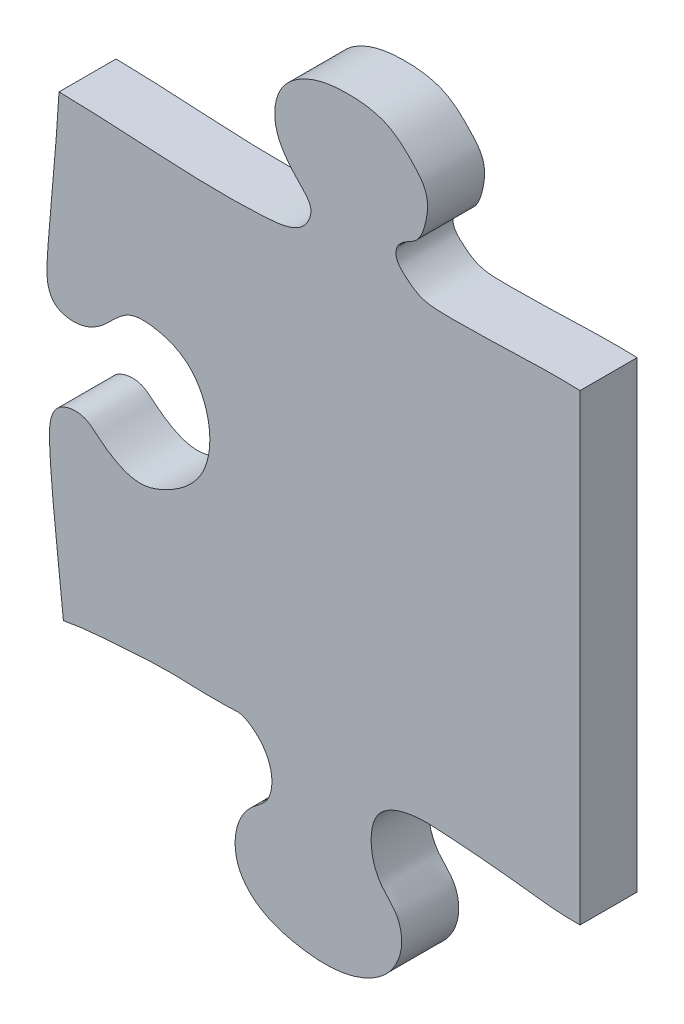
ISO-10303-21;
HEADER;
FILE_DESCRIPTION(('STEP AP214'),'2;1');
FILE_NAME('part.step','',(''),(''),'','','');
FILE_SCHEMA(('AUTOMOTIVE_DESIGN { 1 0 10303 214 1 1 1 1 }'));
ENDSEC;
DATA;
#1=APPLICATION_CONTEXT('core data for automotive mechanical design processes');
#2=APPLICATION_PROTOCOL_DEFINITION('international standard','automotive_design',2000,#1);
#3=PRODUCT_CONTEXT('',#1,'mechanical');
#4=PRODUCT('Part','Part','',(#3));
#5=PRODUCT_RELATED_PRODUCT_CATEGORY('part','',(#4));
#6=PRODUCT_DEFINITION_FORMATION('','',#4);
#7=PRODUCT_DEFINITION_CONTEXT('part definition',#1,'design');
#8=PRODUCT_DEFINITION('design','',#6,#7);
#9=PRODUCT_DEFINITION_SHAPE('','',#8);
#10=(LENGTH_UNIT() NAMED_UNIT(*) SI_UNIT(.MILLI.,.METRE.));
#11=(NAMED_UNIT(*) PLANE_ANGLE_UNIT() SI_UNIT($,.RADIAN.));
#12=(NAMED_UNIT(*) SI_UNIT($,.STERADIAN.) SOLID_ANGLE_UNIT());
#13=UNCERTAINTY_MEASURE_WITH_UNIT(LENGTH_MEASURE(1.E-05),#10,'distance_accuracy_value','');
#14=(GEOMETRIC_REPRESENTATION_CONTEXT(3) GLOBAL_UNCERTAINTY_ASSIGNED_CONTEXT((#13)) GLOBAL_UNIT_ASSIGNED_CONTEXT((#10,
#11,#12)) REPRESENTATION_CONTEXT('',''));
#15=CARTESIAN_POINT('',(0.,0.,0.));
#16=DIRECTION('',(0.,0.,1.));
#17=DIRECTION('',(1.,0.,0.));
#18=AXIS2_PLACEMENT_3D('',#15,#16,#17);
#19=CARTESIAN_POINT('',(325.257058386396,356.,-0.00999999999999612));
#20=CARTESIAN_POINT('',(320.961162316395,345.029410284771,-0.00999999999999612));
#21=CARTESIAN_POINT('',(320.821863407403,330.111228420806,-0.00999999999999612));
#22=CARTESIAN_POINT('',(317.746642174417,310.708405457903,-0.00999999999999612));
#23=CARTESIAN_POINT('',(324.80874526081,302.068845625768,-0.00999999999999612));
#24=CARTESIAN_POINT('',(334.47949844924,301.092198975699,-0.00999999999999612));
#25=CARTESIAN_POINT('',(341.199385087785,308.405018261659,-0.00999999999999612));
#26=CARTESIAN_POINT('',(351.88918877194,310.104343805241,-0.00999999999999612));
#27=CARTESIAN_POINT('',(365.477229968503,308.551893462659,-0.00999999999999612));
#28=CARTESIAN_POINT('',(373.973100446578,293.452904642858,-0.00999999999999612));
#29=CARTESIAN_POINT('',(374.68177629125,275.222888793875,-0.00999999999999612));
#30=CARTESIAN_POINT('',(363.969524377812,260.217712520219,-0.00999999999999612));
#31=CARTESIAN_POINT('',(347.560929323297,258.00994019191,-0.00999999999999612));
#32=CARTESIAN_POINT('',(341.667769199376,269.318092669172,-0.00999999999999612));
#33=CARTESIAN_POINT('',(329.050646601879,268.591464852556,-0.00999999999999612));
#34=CARTESIAN_POINT('',(320.333215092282,258.695380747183,-0.00999999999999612));
#35=CARTESIAN_POINT('',(321.071783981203,237.536716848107,-0.00999999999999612));
#36=CARTESIAN_POINT('',(324.445641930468,214.63289279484,-0.00999999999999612));
#37=CARTESIAN_POINT('',(329.382935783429,185.164436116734,-0.00999999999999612));
#38=CARTESIAN_POINT('',(327.148862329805,151.381238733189,-0.00999999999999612));
#39=CARTESIAN_POINT('',(325.104399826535,122.782989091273,-0.00999999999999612));
#40=CARTESIAN_POINT('',(327.870971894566,95.9027200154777,-0.00999999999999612));
#41=CARTESIAN_POINT('',(342.142457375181,93.3383677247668,-0.00999999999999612));
#42=CARTESIAN_POINT('',(347.900573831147,101.981576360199,-0.00999999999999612));
#43=CARTESIAN_POINT('',(356.834615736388,107.765098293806,-0.00999999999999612));
#44=CARTESIAN_POINT('',(369.379527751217,108.600772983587,-0.00999999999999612));
#45=CARTESIAN_POINT('',(380.120269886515,95.9775166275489,-0.00999999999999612));
#46=CARTESIAN_POINT('',(380.578851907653,78.7451628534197,-0.00999999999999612));
#47=CARTESIAN_POINT('',(375.610818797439,61.7248962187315,-0.00999999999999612));
#48=CARTESIAN_POINT('',(363.715824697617,52.8157722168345,-0.00999999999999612));
#49=CARTESIAN_POINT('',(349.85984979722,55.1705340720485,-0.00999999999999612));
#50=CARTESIAN_POINT('',(346.945856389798,64.810819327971,-0.00999999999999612));
#51=CARTESIAN_POINT('',(338.689797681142,70.9897723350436,-0.00999999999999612));
#52=CARTESIAN_POINT('',(330.580353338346,62.4728514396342,-0.00999999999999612));
#53=CARTESIAN_POINT('',(328.928359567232,48.4436203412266,-0.00999999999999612));
#54=CARTESIAN_POINT('',(329.318852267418,30.6791591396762,-0.00999999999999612));
#55=CARTESIAN_POINT('',(330.266196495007,6.75725364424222,-0.00999999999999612));
#56=CARTESIAN_POINT('',(328.413221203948,-22.8156731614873,-0.00999999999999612));
#57=CARTESIAN_POINT('',(325.957403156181,-47.4645191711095,-0.00999999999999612));
#58=CARTESIAN_POINT('',(324.284943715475,-71.7282942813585,-0.00999999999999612));
#59=CARTESIAN_POINT('',(336.158184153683,-74.5800053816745,-0.00999999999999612));
#60=CARTESIAN_POINT('',(345.605596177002,-70.2479425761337,-0.00999999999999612));
#61=CARTESIAN_POINT('',(352.349142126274,-60.6528291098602,-0.00999999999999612));
#62=CARTESIAN_POINT('',(364.054661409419,-61.084248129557,-0.00999999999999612));
#63=CARTESIAN_POINT('',(376.894401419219,-65.7171784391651,-0.00999999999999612));
#64=CARTESIAN_POINT('',(383.833690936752,-81.7570856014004,-0.00999999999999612));
#65=CARTESIAN_POINT('',(380.385627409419,-99.5380411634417,-0.00999999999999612));
#66=CARTESIAN_POINT('',(369.163029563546,-108.064440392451,-0.00999999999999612));
#67=CARTESIAN_POINT('',(355.487733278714,-112.894616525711,-0.00999999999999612));
#68=CARTESIAN_POINT('',(345.56890588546,-106.804716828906,-0.00999999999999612));
#69=CARTESIAN_POINT('',(337.864154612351,-99.6791187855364,-0.00999999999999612));
#70=CARTESIAN_POINT('',(325.333875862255,-101.340144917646,-0.00999999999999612));
#71=CARTESIAN_POINT('',(326.442256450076,-127.027418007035,-0.00999999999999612));
#72=CARTESIAN_POINT('',(328.990782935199,-147.650339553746,-0.00999999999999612));
#73=CARTESIAN_POINT('',(331.889209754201,-175.720931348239,-0.00999999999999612));
#74=CARTESIAN_POINT('',(333.49389611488,-200.043501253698,-0.00999999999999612));
#75=CARTESIAN_POINT('',(333.062418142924,-222.75850264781,-0.00999999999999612));
#76=CARTESIAN_POINT('',(334.041200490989,-241.335918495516,-0.00999999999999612));
#77=CARTESIAN_POINT('',(324.292862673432,-248.82670983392,-0.00999999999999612));
#78=CARTESIAN_POINT('',(313.862264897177,-249.831348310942,-0.00999999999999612));
#79=CARTESIAN_POINT('',(308.055191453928,-242.821422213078,-0.00999999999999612));
#80=CARTESIAN_POINT('',(300.480173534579,-235.015509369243,-0.00999999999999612));
#81=CARTESIAN_POINT('',(285.021810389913,-234.387092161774,-0.00999999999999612));
#82=CARTESIAN_POINT('',(274.179995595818,-248.432983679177,-0.00999999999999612));
#83=CARTESIAN_POINT('',(270.871780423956,-265.971502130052,-0.00999999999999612));
#84=CARTESIAN_POINT('',(274.212392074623,-284.032454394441,-0.00999999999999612));
#85=CARTESIAN_POINT('',(287.225269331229,-295.05235393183,-0.00999999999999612));
#86=CARTESIAN_POINT('',(300.809811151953,-292.931473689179,-0.00999999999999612));
#87=CARTESIAN_POINT('',(307.364923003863,-284.321305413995,-0.00999999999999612));
#88=CARTESIAN_POINT('',(317.634904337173,-281.646810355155,-0.00999999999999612));
#89=CARTESIAN_POINT('',(335.194502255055,-286.515768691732,-0.00999999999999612));
#90=CARTESIAN_POINT('',(329.900008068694,-321.054322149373,-0.00999999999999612));
#91=CARTESIAN_POINT('',(330.939416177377,-339.80390498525,-0.00999999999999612));
#92=CARTESIAN_POINT('',(328.124742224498,-356.,-0.00999999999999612));
#93=B_SPLINE_CURVE_WITH_KNOTS('',3,(#19,#20,#21,#22,#23,#24,#25,#26,#27,#28,#29,#30,#31,#32,#33,
#34,#35,#36,#37,#38,#39,#40,#41,#42,#43,#44,#45,#46,#47,#48,#49,#50,#51,#52,#53,#54,#55,#56,#57,
#58,#59,#60,#61,#62,#63,#64,#65,#66,#67,#68,#69,#70,#71,#72,#73,#74,#75,#76,#77,#78,#79,#80,#81,
#82,#83,#84,#85,#86,#87,#88,#89,#90,#91,#92),.UNSPECIFIED.,.F.,.F.,(4,1,1,1,1,1,1,1,1,1,1,1,1,1,
1,1,1,1,1,1,1,1,1,1,1,1,1,1,1,1,1,1,1,1,1,1,1,1,1,1,1,1,1,1,1,1,1,1,1,1,1,1,1,1,1,1,1,1,1,1,1,1,
1,1,1,1,1,1,1,1,1,4),(0.,0.0294359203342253,0.0410015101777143,0.0482578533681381,
0.056156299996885,0.0628725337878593,0.0726761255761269,0.0834491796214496,0.0961628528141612,
0.113582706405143,0.1292026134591,0.140393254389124,0.149299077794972,0.1578234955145,
0.168702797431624,0.18034067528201,0.211171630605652,0.230177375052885,0.258218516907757,
0.297936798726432,0.310855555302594,0.319545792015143,0.327782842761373,0.335750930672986,
0.347377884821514,0.35651553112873,0.375682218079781,0.389966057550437,0.401463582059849,
0.411615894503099,0.420595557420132,0.426581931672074,0.43417370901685,0.444880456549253,
0.464136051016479,0.480140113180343,0.507902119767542,0.539252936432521,0.552990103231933,
0.558383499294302,0.567729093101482,0.578921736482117,0.586248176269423,0.596305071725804,
0.613504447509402,0.626237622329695,0.64117705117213,0.647978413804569,0.662971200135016,
0.667795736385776,0.675224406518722,0.689293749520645,0.721613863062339,0.73643728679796,
0.762019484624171,0.785031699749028,0.797726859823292,0.806664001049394,0.814473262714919,
0.822386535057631,0.828765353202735,0.842978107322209,0.855573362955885,0.871677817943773,
0.889062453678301,0.900888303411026,0.912516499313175,0.920249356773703,0.928039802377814,
0.939164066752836,0.961164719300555,1.),.UNSPECIFIED.);
#94=DIRECTION('',(0.,0.,1.));
#95=VECTOR('',#94,1.);
#96=SURFACE_OF_LINEAR_EXTRUSION('',#93,#95);
#97=CARTESIAN_POINT('',(325.257058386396,356.,20.));
#98=CARTESIAN_POINT('',(320.961162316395,345.029410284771,20.));
#99=CARTESIAN_POINT('',(320.821863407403,330.111228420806,20.));
#100=CARTESIAN_POINT('',(317.746642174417,310.708405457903,20.));
#101=CARTESIAN_POINT('',(324.80874526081,302.068845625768,20.));
#102=CARTESIAN_POINT('',(334.47949844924,301.092198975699,20.));
#103=CARTESIAN_POINT('',(341.199385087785,308.405018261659,20.));
#104=CARTESIAN_POINT('',(351.88918877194,310.104343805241,20.));
#105=CARTESIAN_POINT('',(365.477229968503,308.551893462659,20.));
#106=CARTESIAN_POINT('',(373.973100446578,293.452904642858,20.));
#107=CARTESIAN_POINT('',(374.68177629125,275.222888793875,20.));
#108=CARTESIAN_POINT('',(363.969524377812,260.217712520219,20.));
#109=CARTESIAN_POINT('',(347.560929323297,258.00994019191,20.));
#110=CARTESIAN_POINT('',(341.667769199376,269.318092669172,20.));
#111=CARTESIAN_POINT('',(329.050646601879,268.591464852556,20.));
#112=CARTESIAN_POINT('',(320.333215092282,258.695380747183,20.));
#113=CARTESIAN_POINT('',(321.071783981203,237.536716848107,20.));
#114=CARTESIAN_POINT('',(324.445641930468,214.63289279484,20.));
#115=CARTESIAN_POINT('',(329.382935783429,185.164436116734,20.));
#116=CARTESIAN_POINT('',(327.148862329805,151.381238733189,20.));
#117=CARTESIAN_POINT('',(325.104399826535,122.782989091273,20.));
#118=CARTESIAN_POINT('',(327.870971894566,95.9027200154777,20.));
#119=CARTESIAN_POINT('',(342.142457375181,93.3383677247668,20.));
#120=CARTESIAN_POINT('',(347.900573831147,101.981576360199,20.));
#121=CARTESIAN_POINT('',(356.834615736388,107.765098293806,20.));
#122=CARTESIAN_POINT('',(369.379527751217,108.600772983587,20.));
#123=CARTESIAN_POINT('',(380.120269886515,95.9775166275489,20.));
#124=CARTESIAN_POINT('',(380.578851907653,78.7451628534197,20.));
#125=CARTESIAN_POINT('',(375.610818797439,61.7248962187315,20.));
#126=CARTESIAN_POINT('',(363.715824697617,52.8157722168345,20.));
#127=CARTESIAN_POINT('',(349.85984979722,55.1705340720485,20.));
#128=CARTESIAN_POINT('',(346.945856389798,64.810819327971,20.));
#129=CARTESIAN_POINT('',(338.689797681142,70.9897723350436,20.));
#130=CARTESIAN_POINT('',(330.580353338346,62.4728514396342,20.));
#131=CARTESIAN_POINT('',(328.928359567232,48.4436203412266,20.));
#132=CARTESIAN_POINT('',(329.318852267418,30.6791591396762,20.));
#133=CARTESIAN_POINT('',(330.266196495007,6.75725364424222,20.));
#134=CARTESIAN_POINT('',(328.413221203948,-22.8156731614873,20.));
#135=CARTESIAN_POINT('',(325.957403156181,-47.4645191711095,20.));
#136=CARTESIAN_POINT('',(324.284943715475,-71.7282942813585,20.));
#137=CARTESIAN_POINT('',(336.158184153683,-74.5800053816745,20.));
#138=CARTESIAN_POINT('',(345.605596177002,-70.2479425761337,20.));
#139=CARTESIAN_POINT('',(352.349142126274,-60.6528291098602,20.));
#140=CARTESIAN_POINT('',(364.054661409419,-61.084248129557,20.));
#141=CARTESIAN_POINT('',(376.894401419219,-65.7171784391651,20.));
#142=CARTESIAN_POINT('',(383.833690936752,-81.7570856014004,20.));
#143=CARTESIAN_POINT('',(380.385627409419,-99.5380411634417,20.));
#144=CARTESIAN_POINT('',(369.163029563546,-108.064440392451,20.));
#145=CARTESIAN_POINT('',(355.487733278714,-112.894616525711,20.));
#146=CARTESIAN_POINT('',(345.56890588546,-106.804716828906,20.));
#147=CARTESIAN_POINT('',(337.864154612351,-99.6791187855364,20.));
#148=CARTESIAN_POINT('',(325.333875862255,-101.340144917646,20.));
#149=CARTESIAN_POINT('',(326.442256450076,-127.027418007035,20.));
#150=CARTESIAN_POINT('',(328.990782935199,-147.650339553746,20.));
#151=CARTESIAN_POINT('',(331.889209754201,-175.720931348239,20.));
#152=CARTESIAN_POINT('',(333.49389611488,-200.043501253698,20.));
#153=CARTESIAN_POINT('',(333.062418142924,-222.75850264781,20.));
#154=CARTESIAN_POINT('',(334.041200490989,-241.335918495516,20.));
#155=CARTESIAN_POINT('',(324.292862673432,-248.82670983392,20.));
#156=CARTESIAN_POINT('',(313.862264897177,-249.831348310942,20.));
#157=CARTESIAN_POINT('',(308.055191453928,-242.821422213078,20.));
#158=CARTESIAN_POINT('',(300.480173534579,-235.015509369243,20.));
#159=CARTESIAN_POINT('',(285.021810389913,-234.387092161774,20.));
#160=CARTESIAN_POINT('',(274.179995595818,-248.432983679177,20.));
#161=CARTESIAN_POINT('',(270.871780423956,-265.971502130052,20.));
#162=CARTESIAN_POINT('',(274.212392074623,-284.032454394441,20.));
#163=CARTESIAN_POINT('',(287.225269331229,-295.05235393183,20.));
#164=CARTESIAN_POINT('',(300.809811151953,-292.931473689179,20.));
#165=CARTESIAN_POINT('',(307.364923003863,-284.321305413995,20.));
#166=CARTESIAN_POINT('',(317.634904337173,-281.646810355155,20.));
#167=CARTESIAN_POINT('',(335.194502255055,-286.515768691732,20.));
#168=CARTESIAN_POINT('',(329.900008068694,-321.054322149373,20.));
#169=CARTESIAN_POINT('',(330.939416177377,-339.80390498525,20.));
#170=CARTESIAN_POINT('',(328.124742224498,-356.,20.));
#171=B_SPLINE_CURVE_WITH_KNOTS('',3,(#97,#98,#99,#100,#101,#102,#103,#104,#105,#106,#107,#108,
#109,#110,#111,#112,#113,#114,#115,#116,#117,#118,#119,#120,#121,#122,#123,#124,#125,#126,#127,
#128,#129,#130,#131,#132,#133,#134,#135,#136,#137,#138,#139,#140,#141,#142,#143,#144,#145,#146,
#147,#148,#149,#150,#151,#152,#153,#154,#155,#156,#157,#158,#159,#160,#161,#162,#163,#164,#165,
#166,#167,#168,#169,#170),.UNSPECIFIED.,.F.,.F.,(4,1,1,1,1,1,1,1,1,1,1,1,1,1,1,1,1,1,1,1,1,1,1,
1,1,1,1,1,1,1,1,1,1,1,1,1,1,1,1,1,1,1,1,1,1,1,1,1,1,1,1,1,1,1,1,1,1,1,1,1,1,1,1,1,1,1,1,1,1,1,1,
4),(0.,0.0294359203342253,0.0410015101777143,0.0482578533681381,0.056156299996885,
0.0628725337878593,0.0726761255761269,0.0834491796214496,0.0961628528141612,0.113582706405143,
0.1292026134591,0.140393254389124,0.149299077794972,0.1578234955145,0.168702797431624,
0.18034067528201,0.211171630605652,0.230177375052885,0.258218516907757,0.297936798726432,
0.310855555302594,0.319545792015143,0.327782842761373,0.335750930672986,0.347377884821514,
0.35651553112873,0.375682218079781,0.389966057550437,0.401463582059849,0.411615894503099,
0.420595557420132,0.426581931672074,0.43417370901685,0.444880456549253,0.464136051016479,
0.480140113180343,0.507902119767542,0.539252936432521,0.552990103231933,0.558383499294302,
0.567729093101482,0.578921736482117,0.586248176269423,0.596305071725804,0.613504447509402,
0.626237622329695,0.64117705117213,0.647978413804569,0.662971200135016,0.667795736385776,
0.675224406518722,0.689293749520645,0.721613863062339,0.73643728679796,0.762019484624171,
0.785031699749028,0.797726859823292,0.806664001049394,0.814473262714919,0.822386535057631,
0.828765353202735,0.842978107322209,0.855573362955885,0.871677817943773,0.889062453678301,
0.900888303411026,0.912516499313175,0.920249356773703,0.928039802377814,0.939164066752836,
0.961164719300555,1.),.UNSPECIFIED.);
#172=CARTESIAN_POINT('',(329.347506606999,-6.46618719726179,20.));
#173=VERTEX_POINT('',#172);
#174=CARTESIAN_POINT('',(330.882415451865,-166.22555796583,20.));
#175=VERTEX_POINT('',#174);
#176=EDGE_CURVE('E86',#173,#175,#171,.T.);
#177=ORIENTED_EDGE('',*,*,#176,.F.);
#178=DIRECTION('',(0.,0.,1.));
#179=VECTOR('',#178,1.);
#180=CARTESIAN_POINT('',(329.347506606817,-6.46618719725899,-0.00999999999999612));
#181=LINE('',#180,#179);
#182=CARTESIAN_POINT('',(329.347506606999,-6.46618719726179,0.));
#183=VERTEX_POINT('',#182);
#184=EDGE_CURVE('E92',#173,#183,#181,.F.);
#185=ORIENTED_EDGE('',*,*,#184,.T.);
#186=CARTESIAN_POINT('',(325.257058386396,356.,0.));
#187=CARTESIAN_POINT('',(320.961162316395,345.029410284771,0.));
#188=CARTESIAN_POINT('',(320.821863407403,330.111228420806,0.));
#189=CARTESIAN_POINT('',(317.746642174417,310.708405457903,0.));
#190=CARTESIAN_POINT('',(324.80874526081,302.068845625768,0.));
#191=CARTESIAN_POINT('',(334.47949844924,301.092198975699,0.));
#192=CARTESIAN_POINT('',(341.199385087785,308.405018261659,0.));
#193=CARTESIAN_POINT('',(351.88918877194,310.104343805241,0.));
#194=CARTESIAN_POINT('',(365.477229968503,308.551893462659,0.));
#195=CARTESIAN_POINT('',(373.973100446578,293.452904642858,0.));
#196=CARTESIAN_POINT('',(374.68177629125,275.222888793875,0.));
#197=CARTESIAN_POINT('',(363.969524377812,260.217712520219,0.));
#198=CARTESIAN_POINT('',(347.560929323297,258.00994019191,0.));
#199=CARTESIAN_POINT('',(341.667769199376,269.318092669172,0.));
#200=CARTESIAN_POINT('',(329.050646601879,268.591464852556,0.));
#201=CARTESIAN_POINT('',(320.333215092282,258.695380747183,0.));
#202=CARTESIAN_POINT('',(321.071783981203,237.536716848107,0.));
#203=CARTESIAN_POINT('',(324.445641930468,214.63289279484,0.));
#204=CARTESIAN_POINT('',(329.382935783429,185.164436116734,0.));
#205=CARTESIAN_POINT('',(327.148862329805,151.381238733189,0.));
#206=CARTESIAN_POINT('',(325.104399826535,122.782989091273,0.));
#207=CARTESIAN_POINT('',(327.870971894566,95.9027200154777,0.));
#208=CARTESIAN_POINT('',(342.142457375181,93.3383677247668,0.));
#209=CARTESIAN_POINT('',(347.900573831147,101.981576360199,0.));
#210=CARTESIAN_POINT('',(356.834615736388,107.765098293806,0.));
#211=CARTESIAN_POINT('',(369.379527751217,108.600772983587,0.));
#212=CARTESIAN_POINT('',(380.120269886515,95.9775166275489,0.));
#213=CARTESIAN_POINT('',(380.578851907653,78.7451628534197,0.));
#214=CARTESIAN_POINT('',(375.610818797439,61.7248962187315,0.));
#215=CARTESIAN_POINT('',(363.715824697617,52.8157722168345,0.));
#216=CARTESIAN_POINT('',(349.85984979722,55.1705340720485,0.));
#217=CARTESIAN_POINT('',(346.945856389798,64.810819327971,0.));
#218=CARTESIAN_POINT('',(338.689797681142,70.9897723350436,0.));
#219=CARTESIAN_POINT('',(330.580353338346,62.4728514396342,0.));
#220=CARTESIAN_POINT('',(328.928359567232,48.4436203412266,0.));
#221=CARTESIAN_POINT('',(329.318852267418,30.6791591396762,0.));
#222=CARTESIAN_POINT('',(330.266196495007,6.75725364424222,0.));
#223=CARTESIAN_POINT('',(328.413221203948,-22.8156731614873,0.));
#224=CARTESIAN_POINT('',(325.957403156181,-47.4645191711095,0.));
#225=CARTESIAN_POINT('',(324.284943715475,-71.7282942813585,0.));
#226=CARTESIAN_POINT('',(336.158184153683,-74.5800053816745,0.));
#227=CARTESIAN_POINT('',(345.605596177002,-70.2479425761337,0.));
#228=CARTESIAN_POINT('',(352.349142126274,-60.6528291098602,0.));
#229=CARTESIAN_POINT('',(364.054661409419,-61.084248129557,0.));
#230=CARTESIAN_POINT('',(376.894401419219,-65.7171784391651,0.));
#231=CARTESIAN_POINT('',(383.833690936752,-81.7570856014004,0.));
#232=CARTESIAN_POINT('',(380.385627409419,-99.5380411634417,0.));
#233=CARTESIAN_POINT('',(369.163029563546,-108.064440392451,0.));
#234=CARTESIAN_POINT('',(355.487733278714,-112.894616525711,0.));
#235=CARTESIAN_POINT('',(345.56890588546,-106.804716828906,0.));
#236=CARTESIAN_POINT('',(337.864154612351,-99.6791187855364,0.));
#237=CARTESIAN_POINT('',(325.333875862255,-101.340144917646,0.));
#238=CARTESIAN_POINT('',(326.442256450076,-127.027418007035,0.));
#239=CARTESIAN_POINT('',(328.990782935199,-147.650339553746,0.));
#240=CARTESIAN_POINT('',(331.889209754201,-175.720931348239,0.));
#241=CARTESIAN_POINT('',(333.49389611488,-200.043501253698,0.));
#242=CARTESIAN_POINT('',(333.062418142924,-222.75850264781,0.));
#243=CARTESIAN_POINT('',(334.041200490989,-241.335918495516,0.));
#244=CARTESIAN_POINT('',(324.292862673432,-248.82670983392,0.));
#245=CARTESIAN_POINT('',(313.862264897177,-249.831348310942,0.));
#246=CARTESIAN_POINT('',(308.055191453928,-242.821422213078,0.));
#247=CARTESIAN_POINT('',(300.480173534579,-235.015509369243,0.));
#248=CARTESIAN_POINT('',(285.021810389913,-234.387092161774,0.));
#249=CARTESIAN_POINT('',(274.179995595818,-248.432983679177,0.));
#250=CARTESIAN_POINT('',(270.871780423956,-265.971502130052,0.));
#251=CARTESIAN_POINT('',(274.212392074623,-284.032454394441,0.));
#252=CARTESIAN_POINT('',(287.225269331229,-295.05235393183,0.));
#253=CARTESIAN_POINT('',(300.809811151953,-292.931473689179,0.));
#254=CARTESIAN_POINT('',(307.364923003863,-284.321305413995,0.));
#255=CARTESIAN_POINT('',(317.634904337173,-281.646810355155,0.));
#256=CARTESIAN_POINT('',(335.194502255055,-286.515768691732,0.));
#257=CARTESIAN_POINT('',(329.900008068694,-321.054322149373,0.));
#258=CARTESIAN_POINT('',(330.939416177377,-339.80390498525,0.));
#259=CARTESIAN_POINT('',(328.124742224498,-356.,0.));
#260=B_SPLINE_CURVE_WITH_KNOTS('',3,(#186,#187,#188,#189,#190,#191,#192,#193,#194,#195,#196,
#197,#198,#199,#200,#201,#202,#203,#204,#205,#206,#207,#208,#209,#210,#211,#212,#213,#214,#215,
#216,#217,#218,#219,#220,#221,#222,#223,#224,#225,#226,#227,#228,#229,#230,#231,#232,#233,#234,
#235,#236,#237,#238,#239,#240,#241,#242,#243,#244,#245,#246,#247,#248,#249,#250,#251,#252,#253,
#254,#255,#256,#257,#258,#259),.UNSPECIFIED.,.F.,.F.,(4,1,1,1,1,1,1,1,1,1,1,1,1,1,1,1,1,1,1,1,1,
1,1,1,1,1,1,1,1,1,1,1,1,1,1,1,1,1,1,1,1,1,1,1,1,1,1,1,1,1,1,1,1,1,1,1,1,1,1,1,1,1,1,1,1,1,1,1,1,
1,1,4),(0.,0.0294359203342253,0.0410015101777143,0.0482578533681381,0.056156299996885,
0.0628725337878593,0.0726761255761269,0.0834491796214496,0.0961628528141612,0.113582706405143,
0.1292026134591,0.140393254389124,0.149299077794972,0.1578234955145,0.168702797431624,
0.18034067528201,0.211171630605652,0.230177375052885,0.258218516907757,0.297936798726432,
0.310855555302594,0.319545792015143,0.327782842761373,0.335750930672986,0.347377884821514,
0.35651553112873,0.375682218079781,0.389966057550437,0.401463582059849,0.411615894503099,
0.420595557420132,0.426581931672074,0.43417370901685,0.444880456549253,0.464136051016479,
0.480140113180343,0.507902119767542,0.539252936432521,0.552990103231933,0.558383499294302,
0.567729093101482,0.578921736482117,0.586248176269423,0.596305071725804,0.613504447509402,
0.626237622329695,0.64117705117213,0.647978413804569,0.662971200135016,0.667795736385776,
0.675224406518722,0.689293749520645,0.721613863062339,0.73643728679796,0.762019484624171,
0.785031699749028,0.797726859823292,0.806664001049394,0.814473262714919,0.822386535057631,
0.828765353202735,0.842978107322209,0.855573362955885,0.871677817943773,0.889062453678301,
0.900888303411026,0.912516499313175,0.920249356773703,0.928039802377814,0.939164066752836,
0.961164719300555,1.),.UNSPECIFIED.);
#261=CARTESIAN_POINT('',(330.882415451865,-166.22555796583,0.));
#262=VERTEX_POINT('',#261);
#263=EDGE_CURVE('E82',#183,#262,#260,.T.);
#264=ORIENTED_EDGE('',*,*,#263,.T.);
#265=DIRECTION('',(0.,0.,1.));
#266=VECTOR('',#265,1.);
#267=CARTESIAN_POINT('',(330.88241545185,-166.225557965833,-0.00999999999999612));
#268=LINE('',#267,#266);
#269=EDGE_CURVE('E89',#175,#262,#268,.F.);
#270=ORIENTED_EDGE('',*,*,#269,.F.);
#271=EDGE_LOOP('',(#177,#185,#264,#270));
#272=FACE_BOUND('',#271,.T.);
#273=ADVANCED_FACE('F34',(#272),#96,.T.);
#274=CARTESIAN_POINT('',(512.,-356.,20.));
#275=DIRECTION('',(-1.,0.,0.));
#276=DIRECTION('',(0.,0.,1.));
#277=AXIS2_PLACEMENT_3D('',#274,#275,#276);
#278=PLANE('',#277);
#279=DIRECTION('',(0.,0.,1.));
#280=VECTOR('',#279,1.);
#281=CARTESIAN_POINT('',(512.,-168.072880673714,-0.00999999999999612));
#282=LINE('',#281,#280);
#283=CARTESIAN_POINT('',(512.,-168.072880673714,0.));
#284=VERTEX_POINT('',#283);
#285=CARTESIAN_POINT('',(512.,-168.072880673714,20.));
#286=VERTEX_POINT('',#285);
#287=EDGE_CURVE('E137',#284,#286,#282,.T.);
#288=ORIENTED_EDGE('',*,*,#287,.F.);
#289=DIRECTION('',(0.,1.,0.));
#290=VECTOR('',#289,1.);
#291=CARTESIAN_POINT('',(512.,-356.,0.));
#292=LINE('',#291,#290);
#293=CARTESIAN_POINT('',(512.,-5.81701820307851,0.));
#294=VERTEX_POINT('',#293);
#295=EDGE_CURVE('E11',#284,#294,#292,.T.);
#296=ORIENTED_EDGE('',*,*,#295,.T.);
#297=DIRECTION('',(0.,0.,1.));
#298=VECTOR('',#297,1.);
#299=CARTESIAN_POINT('',(512.,-5.81701820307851,-0.00999999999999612));
#300=LINE('',#299,#298);
#301=CARTESIAN_POINT('',(512.,-5.81701820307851,20.));
#302=VERTEX_POINT('',#301);
#303=EDGE_CURVE('E143',#294,#302,#300,.T.);
#304=ORIENTED_EDGE('',*,*,#303,.T.);
#305=DIRECTION('',(0.,1.,0.));
#306=VECTOR('',#305,1.);
#307=CARTESIAN_POINT('',(512.,-356.,20.));
#308=LINE('',#307,#306);
#309=EDGE_CURVE('E45',#286,#302,#308,.T.);
#310=ORIENTED_EDGE('',*,*,#309,.F.);
#311=EDGE_LOOP('',(#288,#296,#304,#310));
#312=FACE_BOUND('',#311,.T.);
#313=ADVANCED_FACE('F118',(#312),#278,.F.);
#314=CARTESIAN_POINT('',(-512.,-172.519287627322,-0.00999999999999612));
#315=CARTESIAN_POINT('',(-502.879283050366,-170.962470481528,-0.00999999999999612));
#316=CARTESIAN_POINT('',(-487.788222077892,-168.37828827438,-0.00999999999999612));
#317=CARTESIAN_POINT('',(-467.037528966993,-166.739801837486,-0.00999999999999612));
#318=CARTESIAN_POINT('',(-454.159365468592,-165.446436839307,-0.00999999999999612));
#319=CARTESIAN_POINT('',(-444.971534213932,-166.107812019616,-0.00999999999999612));
#320=CARTESIAN_POINT('',(-439.850321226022,-171.772015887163,-0.00999999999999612));
#321=CARTESIAN_POINT('',(-440.374957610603,-181.037323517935,-0.00999999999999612));
#322=CARTESIAN_POINT('',(-446.328241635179,-187.391856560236,-0.00999999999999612));
#323=CARTESIAN_POINT('',(-453.905227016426,-194.752671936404,-0.00999999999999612));
#324=CARTESIAN_POINT('',(-453.078389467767,-207.700641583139,-0.00999999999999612));
#325=CARTESIAN_POINT('',(-447.147625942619,-218.930001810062,-0.00999999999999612));
#326=CARTESIAN_POINT('',(-435.337181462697,-224.50074852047,-0.00999999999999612));
#327=CARTESIAN_POINT('',(-423.146614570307,-223.01936726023,-0.00999999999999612));
#328=CARTESIAN_POINT('',(-411.980938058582,-217.277205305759,-0.00999999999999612));
#329=CARTESIAN_POINT('',(-406.065466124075,-206.648631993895,-0.00999999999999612));
#330=CARTESIAN_POINT('',(-404.677696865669,-194.893000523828,-0.00999999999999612));
#331=CARTESIAN_POINT('',(-408.988751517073,-185.080089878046,-0.00999999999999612));
#332=CARTESIAN_POINT('',(-416.250714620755,-179.677092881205,-0.00999999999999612));
#333=CARTESIAN_POINT('',(-414.534960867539,-170.559036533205,-0.00999999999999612));
#334=CARTESIAN_POINT('',(-409.029101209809,-166.771377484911,-0.00999999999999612));
#335=CARTESIAN_POINT('',(-399.765557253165,-166.088529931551,-0.00999999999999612));
#336=CARTESIAN_POINT('',(-387.895154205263,-166.365956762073,-0.00999999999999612));
#337=CARTESIAN_POINT('',(-370.467023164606,-166.815486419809,-0.00999999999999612));
#338=CARTESIAN_POINT('',(-353.468929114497,-167.36046909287,-0.00999999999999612));
#339=CARTESIAN_POINT('',(-335.945481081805,-171.004639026,-0.00999999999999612));
#340=CARTESIAN_POINT('',(-314.642568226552,-174.308910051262,-0.00999999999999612));
#341=CARTESIAN_POINT('',(-295.191530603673,-175.373190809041,-0.00999999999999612));
#342=CARTESIAN_POINT('',(-279.655129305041,-174.532366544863,-0.00999999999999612));
#343=CARTESIAN_POINT('',(-272.871357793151,-169.661223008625,-0.00999999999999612));
#344=CARTESIAN_POINT('',(-269.507556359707,-161.549368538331,-0.00999999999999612));
#345=CARTESIAN_POINT('',(-275.843021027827,-154.65628056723,-0.00999999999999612));
#346=CARTESIAN_POINT('',(-280.95754914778,-144.902856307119,-0.00999999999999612));
#347=CARTESIAN_POINT('',(-276.534312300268,-130.977346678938,-0.00999999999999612));
#348=CARTESIAN_POINT('',(-261.937250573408,-125.579540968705,-0.00999999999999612));
#349=CARTESIAN_POINT('',(-247.663642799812,-124.917748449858,-0.00999999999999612));
#350=CARTESIAN_POINT('',(-234.462562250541,-132.547465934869,-0.00999999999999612));
#351=CARTESIAN_POINT('',(-231.429981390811,-144.191054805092,-0.00999999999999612));
#352=CARTESIAN_POINT('',(-232.066307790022,-154.613730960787,-0.00999999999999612));
#353=CARTESIAN_POINT('',(-238.05545254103,-160.208195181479,-0.00999999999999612));
#354=CARTESIAN_POINT('',(-239.725495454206,-167.504540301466,-0.00999999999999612));
#355=CARTESIAN_POINT('',(-236.616853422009,-176.333406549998,-0.00999999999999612));
#356=CARTESIAN_POINT('',(-223.934770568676,-178.282283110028,-0.00999999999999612));
#357=CARTESIAN_POINT('',(-211.556635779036,-176.87255281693,-0.00999999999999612));
#358=CARTESIAN_POINT('',(-197.283196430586,-172.884179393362,-0.00999999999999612));
#359=CARTESIAN_POINT('',(-182.605892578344,-171.15728588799,-0.00999999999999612));
#360=CARTESIAN_POINT('',(-164.840984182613,-173.659101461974,-0.00999999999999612));
#361=CARTESIAN_POINT('',(-147.945056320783,-175.383809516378,-0.00999999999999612));
#362=CARTESIAN_POINT('',(-131.023155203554,-175.064925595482,-0.00999999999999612));
#363=CARTESIAN_POINT('',(-118.854077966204,-171.888086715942,-0.00999999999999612));
#364=CARTESIAN_POINT('',(-110.251650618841,-164.015375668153,-0.00999999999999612));
#365=CARTESIAN_POINT('',(-112.366058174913,-152.74022327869,-0.00999999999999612));
#366=CARTESIAN_POINT('',(-124.029184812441,-149.21363367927,-0.00999999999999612));
#367=CARTESIAN_POINT('',(-130.728576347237,-135.686086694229,-0.00999999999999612));
#368=CARTESIAN_POINT('',(-127.173489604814,-119.738819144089,-0.00999999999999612));
#369=CARTESIAN_POINT('',(-112.643680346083,-109.612236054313,-0.00999999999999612));
#370=CARTESIAN_POINT('',(-97.8925044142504,-110.264465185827,-0.00999999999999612));
#371=CARTESIAN_POINT('',(-85.3244606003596,-114.886626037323,-0.00999999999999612));
#372=CARTESIAN_POINT('',(-77.7012738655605,-123.996273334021,-0.00999999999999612));
#373=CARTESIAN_POINT('',(-75.1871896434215,-136.082021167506,-0.00999999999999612));
#374=CARTESIAN_POINT('',(-83.4449300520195,-145.685757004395,-0.00999999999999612));
#375=CARTESIAN_POINT('',(-93.6696383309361,-152.57821138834,-0.00999999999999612));
#376=CARTESIAN_POINT('',(-93.6908124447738,-166.777041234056,-0.00999999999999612));
#377=CARTESIAN_POINT('',(-84.1667136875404,-170.982620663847,-0.00999999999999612));
#378=CARTESIAN_POINT('',(-77.6752461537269,-173.278649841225,-0.00999999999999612));
#379=CARTESIAN_POINT('',(-68.1506335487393,-173.35598232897,-0.00999999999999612));
#380=CARTESIAN_POINT('',(-50.9086392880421,-172.467654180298,-0.00999999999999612));
#381=CARTESIAN_POINT('',(-29.3703336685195,-168.255680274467,-0.00999999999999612));
#382=CARTESIAN_POINT('',(-5.85808978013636,-161.016855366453,-0.00999999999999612));
#383=CARTESIAN_POINT('',(10.8279950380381,-157.928962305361,-0.00999999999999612));
#384=CARTESIAN_POINT('',(25.2118575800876,-156.177147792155,-0.00999999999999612));
#385=CARTESIAN_POINT('',(33.2719504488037,-161.887778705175,-0.00999999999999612));
#386=CARTESIAN_POINT('',(35.8385918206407,-171.199049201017,-0.00999999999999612));
#387=CARTESIAN_POINT('',(29.9803253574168,-178.254603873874,-0.00999999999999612));
#388=CARTESIAN_POINT('',(25.4737691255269,-186.687205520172,-0.00999999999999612));
#389=CARTESIAN_POINT('',(28.9610561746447,-203.576557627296,-0.00999999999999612));
#390=CARTESIAN_POINT('',(48.123587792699,-210.569059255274,-0.00999999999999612));
#391=CARTESIAN_POINT('',(64.640055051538,-207.443077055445,-0.00999999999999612));
#392=CARTESIAN_POINT('',(74.3525428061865,-199.315206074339,-0.00999999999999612));
#393=CARTESIAN_POINT('',(75.7823175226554,-188.025012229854,-0.00999999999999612));
#394=CARTESIAN_POINT('',(70.2823025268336,-180.424725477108,-0.00999999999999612));
#395=CARTESIAN_POINT('',(64.0173174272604,-173.04354513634,-0.00999999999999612));
#396=CARTESIAN_POINT('',(71.5185276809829,-158.021609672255,-0.00999999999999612));
#397=CARTESIAN_POINT('',(93.5727320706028,-159.248655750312,-0.00999999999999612));
#398=CARTESIAN_POINT('',(113.740225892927,-158.313305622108,-0.00999999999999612));
#399=CARTESIAN_POINT('',(131.949907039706,-158.592164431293,-0.00999999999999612));
#400=CARTESIAN_POINT('',(148.33531025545,-158.585790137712,-0.00999999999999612));
#401=CARTESIAN_POINT('',(161.926831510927,-159.545351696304,-0.00999999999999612));
#402=CARTESIAN_POINT('',(175.071227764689,-161.773214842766,-0.00999999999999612));
#403=CARTESIAN_POINT('',(191.617950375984,-167.262045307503,-0.00999999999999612));
#404=CARTESIAN_POINT('',(211.099842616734,-169.750201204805,-0.00999999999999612));
#405=CARTESIAN_POINT('',(231.162897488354,-172.887375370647,-0.00999999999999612));
#406=CARTESIAN_POINT('',(248.004345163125,-166.961938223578,-0.00999999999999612));
#407=CARTESIAN_POINT('',(246.8159561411,-153.026737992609,-0.00999999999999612));
#408=CARTESIAN_POINT('',(239.480844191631,-147.244126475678,-0.00999999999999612));
#409=CARTESIAN_POINT('',(236.934105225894,-136.316213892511,-0.00999999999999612));
#410=CARTESIAN_POINT('',(242.714843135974,-119.925321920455,-0.00999999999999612));
#411=CARTESIAN_POINT('',(261.920814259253,-116.243910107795,-0.00999999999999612));
#412=CARTESIAN_POINT('',(276.115384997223,-120.8163533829,-0.00999999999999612));
#413=CARTESIAN_POINT('',(283.920063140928,-128.519918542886,-0.00999999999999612));
#414=CARTESIAN_POINT('',(286.731045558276,-138.27620491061,-0.00999999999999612));
#415=CARTESIAN_POINT('',(285.530131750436,-148.336399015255,-0.00999999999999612));
#416=CARTESIAN_POINT('',(279.231187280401,-154.989394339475,-0.00999999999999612));
#417=CARTESIAN_POINT('',(277.47424541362,-164.19805137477,-0.00999999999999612));
#418=CARTESIAN_POINT('',(282.318065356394,-172.951788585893,-0.00999999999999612));
#419=CARTESIAN_POINT('',(296.661024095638,-174.046241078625,-0.00999999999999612));
#420=CARTESIAN_POINT('',(312.407790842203,-171.220247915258,-0.00999999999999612));
#421=CARTESIAN_POINT('',(331.258502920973,-165.499354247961,-0.00999999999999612));
#422=CARTESIAN_POINT('',(349.515462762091,-164.109048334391,-0.00999999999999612));
#423=CARTESIAN_POINT('',(369.065560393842,-162.668121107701,-0.00999999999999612));
#424=CARTESIAN_POINT('',(383.300131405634,-163.956688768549,-0.00999999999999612));
#425=CARTESIAN_POINT('',(393.167029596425,-163.158367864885,-0.00999999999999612));
#426=CARTESIAN_POINT('',(398.987630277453,-166.389896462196,-0.00999999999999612));
#427=CARTESIAN_POINT('',(404.84494808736,-173.902135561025,-0.00999999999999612));
#428=CARTESIAN_POINT('',(403.877710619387,-184.83720633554,-0.00999999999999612));
#429=CARTESIAN_POINT('',(397.972595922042,-188.779997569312,-0.00999999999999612));
#430=CARTESIAN_POINT('',(391.418741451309,-195.180814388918,-0.00999999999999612));
#431=CARTESIAN_POINT('',(389.486866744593,-207.78576343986,-0.00999999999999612));
#432=CARTESIAN_POINT('',(398.568510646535,-219.719050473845,-0.00999999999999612));
#433=CARTESIAN_POINT('',(413.367098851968,-224.627522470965,-0.00999999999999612));
#434=CARTESIAN_POINT('',(430.645527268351,-225.349016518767,-0.00999999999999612));
#435=CARTESIAN_POINT('',(445.119633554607,-217.990655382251,-0.00999999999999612));
#436=CARTESIAN_POINT('',(450.39877091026,-206.645471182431,-0.00999999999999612));
#437=CARTESIAN_POINT('',(448.623596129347,-196.883477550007,-0.00999999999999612));
#438=CARTESIAN_POINT('',(441.485570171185,-190.93342380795,-0.00999999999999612));
#439=CARTESIAN_POINT('',(437.838155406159,-181.169971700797,-0.00999999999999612));
#440=CARTESIAN_POINT('',(439.616707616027,-168.611761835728,-0.00999999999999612));
#441=CARTESIAN_POINT('',(452.865547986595,-163.032695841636,-0.00999999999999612));
#442=CARTESIAN_POINT('',(467.117395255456,-164.448128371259,-0.00999999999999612));
#443=CARTESIAN_POINT('',(487.604647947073,-165.665160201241,-0.00999999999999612));
#444=CARTESIAN_POINT('',(502.403051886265,-168.291679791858,-0.00999999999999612));
#445=CARTESIAN_POINT('',(512.,-168.072880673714,-0.00999999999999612));
#446=B_SPLINE_CURVE_WITH_KNOTS('',3,(#314,#315,#316,#317,#318,#319,#320,#321,#322,#323,#324,
#325,#326,#327,#328,#329,#330,#331,#332,#333,#334,#335,#336,#337,#338,#339,#340,#341,#342,#343,
#344,#345,#346,#347,#348,#349,#350,#351,#352,#353,#354,#355,#356,#357,#358,#359,#360,#361,#362,
#363,#364,#365,#366,#367,#368,#369,#370,#371,#372,#373,#374,#375,#376,#377,#378,#379,#380,#381,
#382,#383,#384,#385,#386,#387,#388,#389,#390,#391,#392,#393,#394,#395,#396,#397,#398,#399,#400,
#401,#402,#403,#404,#405,#406,#407,#408,#409,#410,#411,#412,#413,#414,#415,#416,#417,#418,#419,
#420,#421,#422,#423,#424,#425,#426,#427,#428,#429,#430,#431,#432,#433,#434,#435,#436,#437,#438,
#439,#440,#441,#442,#443,#444,#445),.UNSPECIFIED.,.F.,.F.,(4,1,1,1,1,1,1,1,1,1,1,1,1,1,1,1,1,1,
1,1,1,1,1,1,1,1,1,1,1,1,1,1,1,1,1,1,1,1,1,1,1,1,1,1,1,1,1,1,1,1,1,1,1,1,1,1,1,1,1,1,1,1,1,1,1,1,
1,1,1,1,1,1,1,1,1,1,1,1,1,1,1,1,1,1,1,1,1,1,1,1,1,1,1,1,1,1,1,1,1,1,1,1,1,1,1,1,1,1,1,1,1,1,1,1,
1,1,1,1,1,1,1,1,1,1,1,1,1,1,1,4),(0.,0.0165769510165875,0.0274671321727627,0.0371464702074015,
0.0400980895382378,0.0433463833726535,0.0497073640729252,0.0544453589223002,0.0588139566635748,
0.0681101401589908,0.0747959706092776,0.0809546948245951,0.0901532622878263,0.095867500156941,
0.102811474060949,0.111015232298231,0.116106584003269,0.121579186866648,0.125543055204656,
0.130677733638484,0.132270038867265,0.141466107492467,0.152619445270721,0.163261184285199,
0.17192085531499,0.184637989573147,0.201793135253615,0.207148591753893,0.211794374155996,
0.216266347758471,0.220719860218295,0.227137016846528,0.235715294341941,0.242716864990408,
0.253632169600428,0.260665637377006,0.267939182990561,0.274072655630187,0.278241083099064,
0.281904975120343,0.287053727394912,0.29279991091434,0.302640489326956,0.309919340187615,
0.319192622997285,0.328902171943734,0.341927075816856,0.349651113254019,0.359095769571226,
0.364234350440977,0.368518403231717,0.376844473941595,0.383449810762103,0.39383324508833,
0.403172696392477,0.412747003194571,0.419192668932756,0.426662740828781,0.433256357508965,
0.43915987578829,0.447945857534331,0.454784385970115,0.459263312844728,0.465316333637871,
0.467037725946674,0.476477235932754,0.496011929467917,0.506346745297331,0.520318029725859,
0.527127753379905,0.530814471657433,0.537296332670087,0.541421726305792,0.546659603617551,
0.554071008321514,0.569060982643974,0.576942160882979,0.583891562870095,0.590293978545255,
0.59495110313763,0.600623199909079,0.605913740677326,0.620422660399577,0.634553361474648,
0.643799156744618,0.652762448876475,0.66399167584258,0.668151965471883,0.676618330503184,
0.695209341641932,0.702656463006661,0.714264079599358,0.719592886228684,0.724033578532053,
0.730384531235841,0.738333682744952,0.752555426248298,0.759343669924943,0.764844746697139,
0.771407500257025,0.776939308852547,0.782103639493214,0.787257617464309,0.792861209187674,
0.797464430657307,0.811466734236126,0.822004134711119,0.832486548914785,0.844241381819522,
0.856894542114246,0.858607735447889,0.861373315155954,0.868279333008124,0.874872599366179,
0.877877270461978,0.880642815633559,0.89130639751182,0.896526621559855,0.906482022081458,
0.917930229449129,0.927070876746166,0.933622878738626,0.939051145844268,0.943432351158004,
0.949734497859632,0.957214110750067,0.963224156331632,0.97316531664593,0.98286869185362,1.),.UNSPECIFIED.);
#447=DIRECTION('',(0.,0.,1.));
#448=VECTOR('',#447,1.);
#449=SURFACE_OF_LINEAR_EXTRUSION('',#446,#448);
#450=CARTESIAN_POINT('',(-512.,-172.519287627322,20.));
#451=CARTESIAN_POINT('',(-502.879283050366,-170.962470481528,20.));
#452=CARTESIAN_POINT('',(-487.788222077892,-168.37828827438,20.));
#453=CARTESIAN_POINT('',(-467.037528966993,-166.739801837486,20.));
#454=CARTESIAN_POINT('',(-454.159365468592,-165.446436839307,20.));
#455=CARTESIAN_POINT('',(-444.971534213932,-166.107812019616,20.));
#456=CARTESIAN_POINT('',(-439.850321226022,-171.772015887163,20.));
#457=CARTESIAN_POINT('',(-440.374957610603,-181.037323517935,20.));
#458=CARTESIAN_POINT('',(-446.328241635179,-187.391856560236,20.));
#459=CARTESIAN_POINT('',(-453.905227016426,-194.752671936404,20.));
#460=CARTESIAN_POINT('',(-453.078389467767,-207.700641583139,20.));
#461=CARTESIAN_POINT('',(-447.147625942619,-218.930001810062,20.));
#462=CARTESIAN_POINT('',(-435.337181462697,-224.50074852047,20.));
#463=CARTESIAN_POINT('',(-423.146614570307,-223.01936726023,20.));
#464=CARTESIAN_POINT('',(-411.980938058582,-217.277205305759,20.));
#465=CARTESIAN_POINT('',(-406.065466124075,-206.648631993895,20.));
#466=CARTESIAN_POINT('',(-404.677696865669,-194.893000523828,20.));
#467=CARTESIAN_POINT('',(-408.988751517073,-185.080089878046,20.));
#468=CARTESIAN_POINT('',(-416.250714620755,-179.677092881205,20.));
#469=CARTESIAN_POINT('',(-414.534960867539,-170.559036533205,20.));
#470=CARTESIAN_POINT('',(-409.029101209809,-166.771377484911,20.));
#471=CARTESIAN_POINT('',(-399.765557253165,-166.088529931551,20.));
#472=CARTESIAN_POINT('',(-387.895154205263,-166.365956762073,20.));
#473=CARTESIAN_POINT('',(-370.467023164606,-166.815486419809,20.));
#474=CARTESIAN_POINT('',(-353.468929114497,-167.36046909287,20.));
#475=CARTESIAN_POINT('',(-335.945481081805,-171.004639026,20.));
#476=CARTESIAN_POINT('',(-314.642568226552,-174.308910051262,20.));
#477=CARTESIAN_POINT('',(-295.191530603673,-175.373190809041,20.));
#478=CARTESIAN_POINT('',(-279.655129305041,-174.532366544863,20.));
#479=CARTESIAN_POINT('',(-272.871357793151,-169.661223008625,20.));
#480=CARTESIAN_POINT('',(-269.507556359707,-161.549368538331,20.));
#481=CARTESIAN_POINT('',(-275.843021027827,-154.65628056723,20.));
#482=CARTESIAN_POINT('',(-280.95754914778,-144.902856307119,20.));
#483=CARTESIAN_POINT('',(-276.534312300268,-130.977346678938,20.));
#484=CARTESIAN_POINT('',(-261.937250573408,-125.579540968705,20.));
#485=CARTESIAN_POINT('',(-247.663642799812,-124.917748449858,20.));
#486=CARTESIAN_POINT('',(-234.462562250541,-132.547465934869,20.));
#487=CARTESIAN_POINT('',(-231.429981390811,-144.191054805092,20.));
#488=CARTESIAN_POINT('',(-232.066307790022,-154.613730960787,20.));
#489=CARTESIAN_POINT('',(-238.05545254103,-160.208195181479,20.));
#490=CARTESIAN_POINT('',(-239.725495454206,-167.504540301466,20.));
#491=CARTESIAN_POINT('',(-236.616853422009,-176.333406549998,20.));
#492=CARTESIAN_POINT('',(-223.934770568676,-178.282283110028,20.));
#493=CARTESIAN_POINT('',(-211.556635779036,-176.87255281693,20.));
#494=CARTESIAN_POINT('',(-197.283196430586,-172.884179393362,20.));
#495=CARTESIAN_POINT('',(-182.605892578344,-171.15728588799,20.));
#496=CARTESIAN_POINT('',(-164.840984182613,-173.659101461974,20.));
#497=CARTESIAN_POINT('',(-147.945056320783,-175.383809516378,20.));
#498=CARTESIAN_POINT('',(-131.023155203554,-175.064925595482,20.));
#499=CARTESIAN_POINT('',(-118.854077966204,-171.888086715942,20.));
#500=CARTESIAN_POINT('',(-110.251650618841,-164.015375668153,20.));
#501=CARTESIAN_POINT('',(-112.366058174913,-152.74022327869,20.));
#502=CARTESIAN_POINT('',(-124.029184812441,-149.21363367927,20.));
#503=CARTESIAN_POINT('',(-130.728576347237,-135.686086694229,20.));
#504=CARTESIAN_POINT('',(-127.173489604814,-119.738819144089,20.));
#505=CARTESIAN_POINT('',(-112.643680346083,-109.612236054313,20.));
#506=CARTESIAN_POINT('',(-97.8925044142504,-110.264465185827,20.));
#507=CARTESIAN_POINT('',(-85.3244606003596,-114.886626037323,20.));
#508=CARTESIAN_POINT('',(-77.7012738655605,-123.996273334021,20.));
#509=CARTESIAN_POINT('',(-75.1871896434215,-136.082021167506,20.));
#510=CARTESIAN_POINT('',(-83.4449300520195,-145.685757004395,20.));
#511=CARTESIAN_POINT('',(-93.6696383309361,-152.57821138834,20.));
#512=CARTESIAN_POINT('',(-93.6908124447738,-166.777041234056,20.));
#513=CARTESIAN_POINT('',(-84.1667136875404,-170.982620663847,20.));
#514=CARTESIAN_POINT('',(-77.6752461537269,-173.278649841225,20.));
#515=CARTESIAN_POINT('',(-68.1506335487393,-173.35598232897,20.));
#516=CARTESIAN_POINT('',(-50.9086392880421,-172.467654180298,20.));
#517=CARTESIAN_POINT('',(-29.3703336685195,-168.255680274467,20.));
#518=CARTESIAN_POINT('',(-5.85808978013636,-161.016855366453,20.));
#519=CARTESIAN_POINT('',(10.8279950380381,-157.928962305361,20.));
#520=CARTESIAN_POINT('',(25.2118575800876,-156.177147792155,20.));
#521=CARTESIAN_POINT('',(33.2719504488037,-161.887778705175,20.));
#522=CARTESIAN_POINT('',(35.8385918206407,-171.199049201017,20.));
#523=CARTESIAN_POINT('',(29.9803253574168,-178.254603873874,20.));
#524=CARTESIAN_POINT('',(25.4737691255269,-186.687205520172,20.));
#525=CARTESIAN_POINT('',(28.9610561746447,-203.576557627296,20.));
#526=CARTESIAN_POINT('',(48.123587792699,-210.569059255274,20.));
#527=CARTESIAN_POINT('',(64.640055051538,-207.443077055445,20.));
#528=CARTESIAN_POINT('',(74.3525428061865,-199.315206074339,20.));
#529=CARTESIAN_POINT('',(75.7823175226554,-188.025012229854,20.));
#530=CARTESIAN_POINT('',(70.2823025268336,-180.424725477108,20.));
#531=CARTESIAN_POINT('',(64.0173174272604,-173.04354513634,20.));
#532=CARTESIAN_POINT('',(71.5185276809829,-158.021609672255,20.));
#533=CARTESIAN_POINT('',(93.5727320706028,-159.248655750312,20.));
#534=CARTESIAN_POINT('',(113.740225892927,-158.313305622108,20.));
#535=CARTESIAN_POINT('',(131.949907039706,-158.592164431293,20.));
#536=CARTESIAN_POINT('',(148.33531025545,-158.585790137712,20.));
#537=CARTESIAN_POINT('',(161.926831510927,-159.545351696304,20.));
#538=CARTESIAN_POINT('',(175.071227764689,-161.773214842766,20.));
#539=CARTESIAN_POINT('',(191.617950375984,-167.262045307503,20.));
#540=CARTESIAN_POINT('',(211.099842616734,-169.750201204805,20.));
#541=CARTESIAN_POINT('',(231.162897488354,-172.887375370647,20.));
#542=CARTESIAN_POINT('',(248.004345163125,-166.961938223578,20.));
#543=CARTESIAN_POINT('',(246.8159561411,-153.026737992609,20.));
#544=CARTESIAN_POINT('',(239.480844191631,-147.244126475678,20.));
#545=CARTESIAN_POINT('',(236.934105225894,-136.316213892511,20.));
#546=CARTESIAN_POINT('',(242.714843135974,-119.925321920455,20.));
#547=CARTESIAN_POINT('',(261.920814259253,-116.243910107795,20.));
#548=CARTESIAN_POINT('',(276.115384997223,-120.8163533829,20.));
#549=CARTESIAN_POINT('',(283.920063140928,-128.519918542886,20.));
#550=CARTESIAN_POINT('',(286.731045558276,-138.27620491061,20.));
#551=CARTESIAN_POINT('',(285.530131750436,-148.336399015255,20.));
#552=CARTESIAN_POINT('',(279.231187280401,-154.989394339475,20.));
#553=CARTESIAN_POINT('',(277.47424541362,-164.19805137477,20.));
#554=CARTESIAN_POINT('',(282.318065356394,-172.951788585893,20.));
#555=CARTESIAN_POINT('',(296.661024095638,-174.046241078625,20.));
#556=CARTESIAN_POINT('',(312.407790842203,-171.220247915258,20.));
#557=CARTESIAN_POINT('',(331.258502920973,-165.499354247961,20.));
#558=CARTESIAN_POINT('',(349.515462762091,-164.109048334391,20.));
#559=CARTESIAN_POINT('',(369.065560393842,-162.668121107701,20.));
#560=CARTESIAN_POINT('',(383.300131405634,-163.956688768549,20.));
#561=CARTESIAN_POINT('',(393.167029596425,-163.158367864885,20.));
#562=CARTESIAN_POINT('',(398.987630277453,-166.389896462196,20.));
#563=CARTESIAN_POINT('',(404.84494808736,-173.902135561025,20.));
#564=CARTESIAN_POINT('',(403.877710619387,-184.83720633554,20.));
#565=CARTESIAN_POINT('',(397.972595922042,-188.779997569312,20.));
#566=CARTESIAN_POINT('',(391.418741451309,-195.180814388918,20.));
#567=CARTESIAN_POINT('',(389.486866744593,-207.78576343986,20.));
#568=CARTESIAN_POINT('',(398.568510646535,-219.719050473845,20.));
#569=CARTESIAN_POINT('',(413.367098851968,-224.627522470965,20.));
#570=CARTESIAN_POINT('',(430.645527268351,-225.349016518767,20.));
#571=CARTESIAN_POINT('',(445.119633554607,-217.990655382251,20.));
#572=CARTESIAN_POINT('',(450.39877091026,-206.645471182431,20.));
#573=CARTESIAN_POINT('',(448.623596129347,-196.883477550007,20.));
#574=CARTESIAN_POINT('',(441.485570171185,-190.93342380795,20.));
#575=CARTESIAN_POINT('',(437.838155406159,-181.169971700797,20.));
#576=CARTESIAN_POINT('',(439.616707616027,-168.611761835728,20.));
#577=CARTESIAN_POINT('',(452.865547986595,-163.032695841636,20.));
#578=CARTESIAN_POINT('',(467.117395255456,-164.448128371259,20.));
#579=CARTESIAN_POINT('',(487.604647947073,-165.665160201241,20.));
#580=CARTESIAN_POINT('',(502.403051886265,-168.291679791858,20.));
#581=CARTESIAN_POINT('',(512.,-168.072880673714,20.));
#582=B_SPLINE_CURVE_WITH_KNOTS('',3,(#450,#451,#452,#453,#454,#455,#456,#457,#458,#459,#460,
#461,#462,#463,#464,#465,#466,#467,#468,#469,#470,#471,#472,#473,#474,#475,#476,#477,#478,#479,
#480,#481,#482,#483,#484,#485,#486,#487,#488,#489,#490,#491,#492,#493,#494,#495,#496,#497,#498,
#499,#500,#501,#502,#503,#504,#505,#506,#507,#508,#509,#510,#511,#512,#513,#514,#515,#516,#517,
#518,#519,#520,#521,#522,#523,#524,#525,#526,#527,#528,#529,#530,#531,#532,#533,#534,#535,#536,
#537,#538,#539,#540,#541,#542,#543,#544,#545,#546,#547,#548,#549,#550,#551,#552,#553,#554,#555,
#556,#557,#558,#559,#560,#561,#562,#563,#564,#565,#566,#567,#568,#569,#570,#571,#572,#573,#574,
#575,#576,#577,#578,#579,#580,#581),.UNSPECIFIED.,.F.,.F.,(4,1,1,1,1,1,1,1,1,1,1,1,1,1,1,1,1,1,
1,1,1,1,1,1,1,1,1,1,1,1,1,1,1,1,1,1,1,1,1,1,1,1,1,1,1,1,1,1,1,1,1,1,1,1,1,1,1,1,1,1,1,1,1,1,1,1,
1,1,1,1,1,1,1,1,1,1,1,1,1,1,1,1,1,1,1,1,1,1,1,1,1,1,1,1,1,1,1,1,1,1,1,1,1,1,1,1,1,1,1,1,1,1,1,1,
1,1,1,1,1,1,1,1,1,1,1,1,1,1,1,4),(0.,0.0165769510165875,0.0274671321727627,0.0371464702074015,
0.0400980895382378,0.0433463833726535,0.0497073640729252,0.0544453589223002,0.0588139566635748,
0.0681101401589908,0.0747959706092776,0.0809546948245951,0.0901532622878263,0.095867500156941,
0.102811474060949,0.111015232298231,0.116106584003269,0.121579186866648,0.125543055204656,
0.130677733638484,0.132270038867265,0.141466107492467,0.152619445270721,0.163261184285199,
0.17192085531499,0.184637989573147,0.201793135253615,0.207148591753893,0.211794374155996,
0.216266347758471,0.220719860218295,0.227137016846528,0.235715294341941,0.242716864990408,
0.253632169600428,0.260665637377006,0.267939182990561,0.274072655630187,0.278241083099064,
0.281904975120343,0.287053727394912,0.29279991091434,0.302640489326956,0.309919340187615,
0.319192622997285,0.328902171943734,0.341927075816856,0.349651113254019,0.359095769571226,
0.364234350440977,0.368518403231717,0.376844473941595,0.383449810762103,0.39383324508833,
0.403172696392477,0.412747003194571,0.419192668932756,0.426662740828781,0.433256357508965,
0.43915987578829,0.447945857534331,0.454784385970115,0.459263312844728,0.465316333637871,
0.467037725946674,0.476477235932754,0.496011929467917,0.506346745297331,0.520318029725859,
0.527127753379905,0.530814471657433,0.537296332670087,0.541421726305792,0.546659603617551,
0.554071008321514,0.569060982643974,0.576942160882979,0.583891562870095,0.590293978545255,
0.59495110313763,0.600623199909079,0.605913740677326,0.620422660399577,0.634553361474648,
0.643799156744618,0.652762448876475,0.66399167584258,0.668151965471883,0.676618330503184,
0.695209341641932,0.702656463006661,0.714264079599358,0.719592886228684,0.724033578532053,
0.730384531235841,0.738333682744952,0.752555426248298,0.759343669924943,0.764844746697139,
0.771407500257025,0.776939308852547,0.782103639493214,0.787257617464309,0.792861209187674,
0.797464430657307,0.811466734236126,0.822004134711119,0.832486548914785,0.844241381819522,
0.856894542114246,0.858607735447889,0.861373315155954,0.868279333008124,0.874872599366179,
0.877877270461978,0.880642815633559,0.89130639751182,0.896526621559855,0.906482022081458,
0.917930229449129,0.927070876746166,0.933622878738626,0.939051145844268,0.943432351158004,
0.949734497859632,0.957214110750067,0.963224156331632,0.97316531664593,0.98286869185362,1.),.UNSPECIFIED.);
#583=EDGE_CURVE('E61',#175,#286,#582,.T.);
#584=ORIENTED_EDGE('',*,*,#583,.F.);
#585=ORIENTED_EDGE('',*,*,#269,.T.);
#586=CARTESIAN_POINT('',(-512.,-172.519287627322,0.));
#587=CARTESIAN_POINT('',(-502.879283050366,-170.962470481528,0.));
#588=CARTESIAN_POINT('',(-487.788222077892,-168.37828827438,0.));
#589=CARTESIAN_POINT('',(-467.037528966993,-166.739801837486,0.));
#590=CARTESIAN_POINT('',(-454.159365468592,-165.446436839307,0.));
#591=CARTESIAN_POINT('',(-444.971534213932,-166.107812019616,0.));
#592=CARTESIAN_POINT('',(-439.850321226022,-171.772015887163,0.));
#593=CARTESIAN_POINT('',(-440.374957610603,-181.037323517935,0.));
#594=CARTESIAN_POINT('',(-446.328241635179,-187.391856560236,0.));
#595=CARTESIAN_POINT('',(-453.905227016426,-194.752671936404,0.));
#596=CARTESIAN_POINT('',(-453.078389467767,-207.700641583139,0.));
#597=CARTESIAN_POINT('',(-447.147625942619,-218.930001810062,0.));
#598=CARTESIAN_POINT('',(-435.337181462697,-224.50074852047,0.));
#599=CARTESIAN_POINT('',(-423.146614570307,-223.01936726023,0.));
#600=CARTESIAN_POINT('',(-411.980938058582,-217.277205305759,0.));
#601=CARTESIAN_POINT('',(-406.065466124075,-206.648631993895,0.));
#602=CARTESIAN_POINT('',(-404.677696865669,-194.893000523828,0.));
#603=CARTESIAN_POINT('',(-408.988751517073,-185.080089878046,0.));
#604=CARTESIAN_POINT('',(-416.250714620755,-179.677092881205,0.));
#605=CARTESIAN_POINT('',(-414.534960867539,-170.559036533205,0.));
#606=CARTESIAN_POINT('',(-409.029101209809,-166.771377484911,0.));
#607=CARTESIAN_POINT('',(-399.765557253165,-166.088529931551,0.));
#608=CARTESIAN_POINT('',(-387.895154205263,-166.365956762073,0.));
#609=CARTESIAN_POINT('',(-370.467023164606,-166.815486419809,0.));
#610=CARTESIAN_POINT('',(-353.468929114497,-167.36046909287,0.));
#611=CARTESIAN_POINT('',(-335.945481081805,-171.004639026,0.));
#612=CARTESIAN_POINT('',(-314.642568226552,-174.308910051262,0.));
#613=CARTESIAN_POINT('',(-295.191530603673,-175.373190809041,0.));
#614=CARTESIAN_POINT('',(-279.655129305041,-174.532366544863,0.));
#615=CARTESIAN_POINT('',(-272.871357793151,-169.661223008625,0.));
#616=CARTESIAN_POINT('',(-269.507556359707,-161.549368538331,0.));
#617=CARTESIAN_POINT('',(-275.843021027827,-154.65628056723,0.));
#618=CARTESIAN_POINT('',(-280.95754914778,-144.902856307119,0.));
#619=CARTESIAN_POINT('',(-276.534312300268,-130.977346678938,0.));
#620=CARTESIAN_POINT('',(-261.937250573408,-125.579540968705,0.));
#621=CARTESIAN_POINT('',(-247.663642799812,-124.917748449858,0.));
#622=CARTESIAN_POINT('',(-234.462562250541,-132.547465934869,0.));
#623=CARTESIAN_POINT('',(-231.429981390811,-144.191054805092,0.));
#624=CARTESIAN_POINT('',(-232.066307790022,-154.613730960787,0.));
#625=CARTESIAN_POINT('',(-238.05545254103,-160.208195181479,0.));
#626=CARTESIAN_POINT('',(-239.725495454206,-167.504540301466,0.));
#627=CARTESIAN_POINT('',(-236.616853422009,-176.333406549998,0.));
#628=CARTESIAN_POINT('',(-223.934770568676,-178.282283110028,0.));
#629=CARTESIAN_POINT('',(-211.556635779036,-176.87255281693,0.));
#630=CARTESIAN_POINT('',(-197.283196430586,-172.884179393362,0.));
#631=CARTESIAN_POINT('',(-182.605892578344,-171.15728588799,0.));
#632=CARTESIAN_POINT('',(-164.840984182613,-173.659101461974,0.));
#633=CARTESIAN_POINT('',(-147.945056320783,-175.383809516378,0.));
#634=CARTESIAN_POINT('',(-131.023155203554,-175.064925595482,0.));
#635=CARTESIAN_POINT('',(-118.854077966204,-171.888086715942,0.));
#636=CARTESIAN_POINT('',(-110.251650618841,-164.015375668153,0.));
#637=CARTESIAN_POINT('',(-112.366058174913,-152.74022327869,0.));
#638=CARTESIAN_POINT('',(-124.029184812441,-149.21363367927,0.));
#639=CARTESIAN_POINT('',(-130.728576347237,-135.686086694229,0.));
#640=CARTESIAN_POINT('',(-127.173489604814,-119.738819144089,0.));
#641=CARTESIAN_POINT('',(-112.643680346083,-109.612236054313,0.));
#642=CARTESIAN_POINT('',(-97.8925044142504,-110.264465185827,0.));
#643=CARTESIAN_POINT('',(-85.3244606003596,-114.886626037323,0.));
#644=CARTESIAN_POINT('',(-77.7012738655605,-123.996273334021,0.));
#645=CARTESIAN_POINT('',(-75.1871896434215,-136.082021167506,0.));
#646=CARTESIAN_POINT('',(-83.4449300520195,-145.685757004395,0.));
#647=CARTESIAN_POINT('',(-93.6696383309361,-152.57821138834,0.));
#648=CARTESIAN_POINT('',(-93.6908124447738,-166.777041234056,0.));
#649=CARTESIAN_POINT('',(-84.1667136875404,-170.982620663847,0.));
#650=CARTESIAN_POINT('',(-77.6752461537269,-173.278649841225,0.));
#651=CARTESIAN_POINT('',(-68.1506335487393,-173.35598232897,0.));
#652=CARTESIAN_POINT('',(-50.9086392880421,-172.467654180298,0.));
#653=CARTESIAN_POINT('',(-29.3703336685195,-168.255680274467,0.));
#654=CARTESIAN_POINT('',(-5.85808978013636,-161.016855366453,0.));
#655=CARTESIAN_POINT('',(10.8279950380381,-157.928962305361,0.));
#656=CARTESIAN_POINT('',(25.2118575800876,-156.177147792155,0.));
#657=CARTESIAN_POINT('',(33.2719504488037,-161.887778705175,0.));
#658=CARTESIAN_POINT('',(35.8385918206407,-171.199049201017,0.));
#659=CARTESIAN_POINT('',(29.9803253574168,-178.254603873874,0.));
#660=CARTESIAN_POINT('',(25.4737691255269,-186.687205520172,0.));
#661=CARTESIAN_POINT('',(28.9610561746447,-203.576557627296,0.));
#662=CARTESIAN_POINT('',(48.123587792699,-210.569059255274,0.));
#663=CARTESIAN_POINT('',(64.640055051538,-207.443077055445,0.));
#664=CARTESIAN_POINT('',(74.3525428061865,-199.315206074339,0.));
#665=CARTESIAN_POINT('',(75.7823175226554,-188.025012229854,0.));
#666=CARTESIAN_POINT('',(70.2823025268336,-180.424725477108,0.));
#667=CARTESIAN_POINT('',(64.0173174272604,-173.04354513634,0.));
#668=CARTESIAN_POINT('',(71.5185276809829,-158.021609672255,0.));
#669=CARTESIAN_POINT('',(93.5727320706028,-159.248655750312,0.));
#670=CARTESIAN_POINT('',(113.740225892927,-158.313305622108,0.));
#671=CARTESIAN_POINT('',(131.949907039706,-158.592164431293,0.));
#672=CARTESIAN_POINT('',(148.33531025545,-158.585790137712,0.));
#673=CARTESIAN_POINT('',(161.926831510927,-159.545351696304,0.));
#674=CARTESIAN_POINT('',(175.071227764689,-161.773214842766,0.));
#675=CARTESIAN_POINT('',(191.617950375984,-167.262045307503,0.));
#676=CARTESIAN_POINT('',(211.099842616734,-169.750201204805,0.));
#677=CARTESIAN_POINT('',(231.162897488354,-172.887375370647,0.));
#678=CARTESIAN_POINT('',(248.004345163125,-166.961938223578,0.));
#679=CARTESIAN_POINT('',(246.8159561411,-153.026737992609,0.));
#680=CARTESIAN_POINT('',(239.480844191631,-147.244126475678,0.));
#681=CARTESIAN_POINT('',(236.934105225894,-136.316213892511,0.));
#682=CARTESIAN_POINT('',(242.714843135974,-119.925321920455,0.));
#683=CARTESIAN_POINT('',(261.920814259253,-116.243910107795,0.));
#684=CARTESIAN_POINT('',(276.115384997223,-120.8163533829,0.));
#685=CARTESIAN_POINT('',(283.920063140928,-128.519918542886,0.));
#686=CARTESIAN_POINT('',(286.731045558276,-138.27620491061,0.));
#687=CARTESIAN_POINT('',(285.530131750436,-148.336399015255,0.));
#688=CARTESIAN_POINT('',(279.231187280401,-154.989394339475,0.));
#689=CARTESIAN_POINT('',(277.47424541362,-164.19805137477,0.));
#690=CARTESIAN_POINT('',(282.318065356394,-172.951788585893,0.));
#691=CARTESIAN_POINT('',(296.661024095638,-174.046241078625,0.));
#692=CARTESIAN_POINT('',(312.407790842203,-171.220247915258,0.));
#693=CARTESIAN_POINT('',(331.258502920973,-165.499354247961,0.));
#694=CARTESIAN_POINT('',(349.515462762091,-164.109048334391,0.));
#695=CARTESIAN_POINT('',(369.065560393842,-162.668121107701,0.));
#696=CARTESIAN_POINT('',(383.300131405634,-163.956688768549,0.));
#697=CARTESIAN_POINT('',(393.167029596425,-163.158367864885,0.));
#698=CARTESIAN_POINT('',(398.987630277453,-166.389896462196,0.));
#699=CARTESIAN_POINT('',(404.84494808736,-173.902135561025,0.));
#700=CARTESIAN_POINT('',(403.877710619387,-184.83720633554,0.));
#701=CARTESIAN_POINT('',(397.972595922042,-188.779997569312,0.));
#702=CARTESIAN_POINT('',(391.418741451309,-195.180814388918,0.));
#703=CARTESIAN_POINT('',(389.486866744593,-207.78576343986,0.));
#704=CARTESIAN_POINT('',(398.568510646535,-219.719050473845,0.));
#705=CARTESIAN_POINT('',(413.367098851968,-224.627522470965,0.));
#706=CARTESIAN_POINT('',(430.645527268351,-225.349016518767,0.));
#707=CARTESIAN_POINT('',(445.119633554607,-217.990655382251,0.));
#708=CARTESIAN_POINT('',(450.39877091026,-206.645471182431,0.));
#709=CARTESIAN_POINT('',(448.623596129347,-196.883477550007,0.));
#710=CARTESIAN_POINT('',(441.485570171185,-190.93342380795,0.));
#711=CARTESIAN_POINT('',(437.838155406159,-181.169971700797,0.));
#712=CARTESIAN_POINT('',(439.616707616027,-168.611761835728,0.));
#713=CARTESIAN_POINT('',(452.865547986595,-163.032695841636,0.));
#714=CARTESIAN_POINT('',(467.117395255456,-164.448128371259,0.));
#715=CARTESIAN_POINT('',(487.604647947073,-165.665160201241,0.));
#716=CARTESIAN_POINT('',(502.403051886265,-168.291679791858,0.));
#717=CARTESIAN_POINT('',(512.,-168.072880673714,0.));
#718=B_SPLINE_CURVE_WITH_KNOTS('',3,(#586,#587,#588,#589,#590,#591,#592,#593,#594,#595,#596,
#597,#598,#599,#600,#601,#602,#603,#604,#605,#606,#607,#608,#609,#610,#611,#612,#613,#614,#615,
#616,#617,#618,#619,#620,#621,#622,#623,#624,#625,#626,#627,#628,#629,#630,#631,#632,#633,#634,
#635,#636,#637,#638,#639,#640,#641,#642,#643,#644,#645,#646,#647,#648,#649,#650,#651,#652,#653,
#654,#655,#656,#657,#658,#659,#660,#661,#662,#663,#664,#665,#666,#667,#668,#669,#670,#671,#672,
#673,#674,#675,#676,#677,#678,#679,#680,#681,#682,#683,#684,#685,#686,#687,#688,#689,#690,#691,
#692,#693,#694,#695,#696,#697,#698,#699,#700,#701,#702,#703,#704,#705,#706,#707,#708,#709,#710,
#711,#712,#713,#714,#715,#716,#717),.UNSPECIFIED.,.F.,.F.,(4,1,1,1,1,1,1,1,1,1,1,1,1,1,1,1,1,1,
1,1,1,1,1,1,1,1,1,1,1,1,1,1,1,1,1,1,1,1,1,1,1,1,1,1,1,1,1,1,1,1,1,1,1,1,1,1,1,1,1,1,1,1,1,1,1,1,
1,1,1,1,1,1,1,1,1,1,1,1,1,1,1,1,1,1,1,1,1,1,1,1,1,1,1,1,1,1,1,1,1,1,1,1,1,1,1,1,1,1,1,1,1,1,1,1,
1,1,1,1,1,1,1,1,1,1,1,1,1,1,1,4),(0.,0.0165769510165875,0.0274671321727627,0.0371464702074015,
0.0400980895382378,0.0433463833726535,0.0497073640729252,0.0544453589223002,0.0588139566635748,
0.0681101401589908,0.0747959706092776,0.0809546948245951,0.0901532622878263,0.095867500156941,
0.102811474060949,0.111015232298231,0.116106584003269,0.121579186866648,0.125543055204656,
0.130677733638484,0.132270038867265,0.141466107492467,0.152619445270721,0.163261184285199,
0.17192085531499,0.184637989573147,0.201793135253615,0.207148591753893,0.211794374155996,
0.216266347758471,0.220719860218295,0.227137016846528,0.235715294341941,0.242716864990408,
0.253632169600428,0.260665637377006,0.267939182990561,0.274072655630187,0.278241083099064,
0.281904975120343,0.287053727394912,0.29279991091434,0.302640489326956,0.309919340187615,
0.319192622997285,0.328902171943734,0.341927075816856,0.349651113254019,0.359095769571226,
0.364234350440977,0.368518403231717,0.376844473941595,0.383449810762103,0.39383324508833,
0.403172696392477,0.412747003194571,0.419192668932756,0.426662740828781,0.433256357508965,
0.43915987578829,0.447945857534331,0.454784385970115,0.459263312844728,0.465316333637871,
0.467037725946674,0.476477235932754,0.496011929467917,0.506346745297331,0.520318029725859,
0.527127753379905,0.530814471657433,0.537296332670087,0.541421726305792,0.546659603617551,
0.554071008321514,0.569060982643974,0.576942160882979,0.583891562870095,0.590293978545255,
0.59495110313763,0.600623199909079,0.605913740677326,0.620422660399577,0.634553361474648,
0.643799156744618,0.652762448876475,0.66399167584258,0.668151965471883,0.676618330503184,
0.695209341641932,0.702656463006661,0.714264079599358,0.719592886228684,0.724033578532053,
0.730384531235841,0.738333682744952,0.752555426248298,0.759343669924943,0.764844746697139,
0.771407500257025,0.776939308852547,0.782103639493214,0.787257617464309,0.792861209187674,
0.797464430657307,0.811466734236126,0.822004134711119,0.832486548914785,0.844241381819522,
0.856894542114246,0.858607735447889,0.861373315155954,0.868279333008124,0.874872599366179,
0.877877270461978,0.880642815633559,0.89130639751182,0.896526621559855,0.906482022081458,
0.917930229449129,0.927070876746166,0.933622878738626,0.939051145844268,0.943432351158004,
0.949734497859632,0.957214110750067,0.963224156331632,0.97316531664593,0.98286869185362,1.),.UNSPECIFIED.);
#719=EDGE_CURVE('E78',#262,#284,#718,.T.);
#720=ORIENTED_EDGE('',*,*,#719,.T.);
#721=ORIENTED_EDGE('',*,*,#287,.T.);
#722=EDGE_LOOP('',(#584,#585,#720,#721));
#723=FACE_BOUND('',#722,.T.);
#724=ADVANCED_FACE('F90',(#723),#449,.T.);
#725=CARTESIAN_POINT('',(-349.139880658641,5.30046994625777,-0.00999999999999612));
#726=CARTESIAN_POINT('',(-339.887860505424,5.11479546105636,-0.00999999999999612));
#727=CARTESIAN_POINT('',(-319.891606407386,5.70075392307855,-0.00999999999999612));
#728=CARTESIAN_POINT('',(-312.057252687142,6.39377361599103,-0.00999999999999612));
#729=CARTESIAN_POINT('',(-295.557040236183,6.5821024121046,-0.00999999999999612));
#730=CARTESIAN_POINT('',(-287.520649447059,5.38238329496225,-0.00999999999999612));
#731=CARTESIAN_POINT('',(-282.231232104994,-0.739375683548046,-0.00999999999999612));
#732=CARTESIAN_POINT('',(-284.631758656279,-6.70157001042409,-0.00999999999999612));
#733=CARTESIAN_POINT('',(-290.291633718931,-11.4270553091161,-0.00999999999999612));
#734=CARTESIAN_POINT('',(-294.264404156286,-19.1154923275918,-0.00999999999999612));
#735=CARTESIAN_POINT('',(-294.324045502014,-31.0075730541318,-0.00999999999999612));
#736=CARTESIAN_POINT('',(-285.696757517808,-42.2618535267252,-0.00999999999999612));
#737=CARTESIAN_POINT('',(-271.389959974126,-47.4058055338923,-0.00999999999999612));
#738=CARTESIAN_POINT('',(-259.358947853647,-47.5927514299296,-0.00999999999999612));
#739=CARTESIAN_POINT('',(-248.949507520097,-41.269541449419,-0.00999999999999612));
#740=CARTESIAN_POINT('',(-243.879910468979,-32.2576865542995,-0.00999999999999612));
#741=CARTESIAN_POINT('',(-242.928014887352,-21.7896256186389,-0.00999999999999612));
#742=CARTESIAN_POINT('',(-249.227477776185,-14.851631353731,-0.00999999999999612));
#743=CARTESIAN_POINT('',(-254.593465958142,-9.43942563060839,-0.00999999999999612));
#744=CARTESIAN_POINT('',(-258.137345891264,-1.50662300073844,-0.00999999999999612));
#745=CARTESIAN_POINT('',(-253.898534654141,5.55474508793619,-0.00999999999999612));
#746=CARTESIAN_POINT('',(-243.567188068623,7.43755302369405,-0.00999999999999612));
#747=CARTESIAN_POINT('',(-237.879490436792,6.8669695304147,-0.00999999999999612));
#748=CARTESIAN_POINT('',(-212.535663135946,4.31355413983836,-0.00999999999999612));
#749=CARTESIAN_POINT('',(-204.857637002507,3.06770049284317,-0.00999999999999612));
#750=CARTESIAN_POINT('',(-187.870824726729,0.576823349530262,-0.00999999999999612));
#751=CARTESIAN_POINT('',(-180.873341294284,-0.585089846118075,-0.00999999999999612));
#752=CARTESIAN_POINT('',(-167.321297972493,-4.05861827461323,-0.00999999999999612));
#753=CARTESIAN_POINT('',(-158.264072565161,-5.81322262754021,-0.00999999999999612));
#754=CARTESIAN_POINT('',(-139.329328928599,-8.34288673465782,-0.00999999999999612));
#755=CARTESIAN_POINT('',(-132.040798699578,-2.9845391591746,-0.00999999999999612));
#756=CARTESIAN_POINT('',(-129.761885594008,4.23046807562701,-0.00999999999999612));
#757=CARTESIAN_POINT('',(-131.710784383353,10.4013258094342,-0.00999999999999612));
#758=CARTESIAN_POINT('',(-133.710968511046,14.6601816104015,-0.00999999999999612));
#759=CARTESIAN_POINT('',(-138.026269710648,21.724753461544,-0.00999999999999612));
#760=CARTESIAN_POINT('',(-138.081917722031,32.3728530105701,-0.00999999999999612));
#761=CARTESIAN_POINT('',(-131.83570692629,43.0815337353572,-0.00999999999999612));
#762=CARTESIAN_POINT('',(-119.794248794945,47.304204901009,-0.00999999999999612));
#763=CARTESIAN_POINT('',(-108.957899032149,47.5382470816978,-0.00999999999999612));
#764=CARTESIAN_POINT('',(-96.8719484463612,45.7015776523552,-0.00999999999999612));
#765=CARTESIAN_POINT('',(-87.0853124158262,37.0457421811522,-0.00999999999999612));
#766=CARTESIAN_POINT('',(-87.3806461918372,25.6113797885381,-0.00999999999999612));
#767=CARTESIAN_POINT('',(-91.1138584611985,18.4470720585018,-0.00999999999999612));
#768=CARTESIAN_POINT('',(-96.1690771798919,13.9582424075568,-0.00999999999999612));
#769=CARTESIAN_POINT('',(-97.7539111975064,6.63580226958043,-0.00999999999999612));
#770=CARTESIAN_POINT('',(-93.1531213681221,0.225805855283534,-0.00999999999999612));
#771=CARTESIAN_POINT('',(-85.7868945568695,-4.22125029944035,-0.00999999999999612));
#772=CARTESIAN_POINT('',(-75.4922823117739,-4.72742713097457,-0.00999999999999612));
#773=CARTESIAN_POINT('',(-63.6021774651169,-3.739894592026,-0.00999999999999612));
#774=CARTESIAN_POINT('',(-47.1576847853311,-2.15281130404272,-0.00999999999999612));
#775=CARTESIAN_POINT('',(-35.4735305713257,-1.02782701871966,-0.00999999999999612));
#776=CARTESIAN_POINT('',(-9.55974097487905,5.44923466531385,-0.00999999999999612));
#777=CARTESIAN_POINT('',(5.33335319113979,5.64341864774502,-0.00999999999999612));
#778=CARTESIAN_POINT('',(26.8877087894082,6.61154693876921,-0.00999999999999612));
#779=CARTESIAN_POINT('',(40.3616385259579,6.66752296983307,-0.00999999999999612));
#780=CARTESIAN_POINT('',(55.4069140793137,6.55682515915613,-0.00999999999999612));
#781=CARTESIAN_POINT('',(60.9823316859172,-1.76204700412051,-0.00999999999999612));
#782=CARTESIAN_POINT('',(62.7286219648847,-10.7101888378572,-0.00999999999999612));
#783=CARTESIAN_POINT('',(58.0719160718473,-18.2162229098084,-0.00999999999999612));
#784=CARTESIAN_POINT('',(50.4934538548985,-22.6369036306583,-0.00999999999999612));
#785=CARTESIAN_POINT('',(49.5191525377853,-32.4601424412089,-0.00999999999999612));
#786=CARTESIAN_POINT('',(50.9102608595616,-43.3041677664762,-0.00999999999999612));
#787=CARTESIAN_POINT('',(60.9494806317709,-51.7611152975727,-0.00999999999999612));
#788=CARTESIAN_POINT('',(73.8438777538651,-54.9427485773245,-0.00999999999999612));
#789=CARTESIAN_POINT('',(86.4324503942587,-54.0451489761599,-0.00999999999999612));
#790=CARTESIAN_POINT('',(96.2763408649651,-49.8211627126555,-0.00999999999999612));
#791=CARTESIAN_POINT('',(101.788676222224,-42.6926438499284,-0.00999999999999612));
#792=CARTESIAN_POINT('',(103.785622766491,-33.9307441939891,-0.00999999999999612));
#793=CARTESIAN_POINT('',(101.793989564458,-26.0744158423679,-0.00999999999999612));
#794=CARTESIAN_POINT('',(95.2302198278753,-18.82812621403,-0.00999999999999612));
#795=CARTESIAN_POINT('',(89.6165079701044,-10.8535457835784,-0.00999999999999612));
#796=CARTESIAN_POINT('',(88.5833289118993,0.119561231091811,-0.00999999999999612));
#797=CARTESIAN_POINT('',(98.1406475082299,6.80161389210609,-0.00999999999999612));
#798=CARTESIAN_POINT('',(110.075702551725,4.83412068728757,-0.00999999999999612));
#799=CARTESIAN_POINT('',(121.713926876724,4.79342247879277,-0.00999999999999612));
#800=CARTESIAN_POINT('',(136.161134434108,3.20442078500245,-0.00999999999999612));
#801=CARTESIAN_POINT('',(149.301551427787,2.24618232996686,-0.00999999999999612));
#802=CARTESIAN_POINT('',(163.635697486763,1.11607382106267,-0.00999999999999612));
#803=CARTESIAN_POINT('',(175.743984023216,-0.930199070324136,-0.00999999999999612));
#804=CARTESIAN_POINT('',(193.50042565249,-4.03526402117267,-0.00999999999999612));
#805=CARTESIAN_POINT('',(199.307125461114,-4.82007249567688,-0.00999999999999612));
#806=CARTESIAN_POINT('',(223.191668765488,-7.20796265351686,-0.00999999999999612));
#807=CARTESIAN_POINT('',(234.005762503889,-7.89583073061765,-0.00999999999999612));
#808=CARTESIAN_POINT('',(243.165304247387,-4.21144732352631,-0.00999999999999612));
#809=CARTESIAN_POINT('',(242.728227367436,5.29385628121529,-0.00999999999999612));
#810=CARTESIAN_POINT('',(239.691190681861,13.3923508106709,-0.00999999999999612));
#811=CARTESIAN_POINT('',(230.992924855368,17.259551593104,-0.00999999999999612));
#812=CARTESIAN_POINT('',(228.562234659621,35.6530691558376,-0.00999999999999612));
#813=CARTESIAN_POINT('',(241.485133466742,51.1639498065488,-0.00999999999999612));
#814=CARTESIAN_POINT('',(261.294428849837,50.4989765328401,-0.00999999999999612));
#815=CARTESIAN_POINT('',(273.311157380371,41.2796485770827,-0.00999999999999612));
#816=CARTESIAN_POINT('',(278.244185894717,29.7939334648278,-0.00999999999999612));
#817=CARTESIAN_POINT('',(278.46311043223,19.1716807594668,-0.00999999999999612));
#818=CARTESIAN_POINT('',(273.41239647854,11.7823053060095,-0.00999999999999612));
#819=CARTESIAN_POINT('',(269.462797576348,8.07180362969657,-0.00999999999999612));
#820=CARTESIAN_POINT('',(268.275297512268,1.27447756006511,-0.00999999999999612));
#821=CARTESIAN_POINT('',(269.56536006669,-2.1294813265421,-0.00999999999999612));
#822=CARTESIAN_POINT('',(273.239630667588,-8.77034024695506,-0.00999999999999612));
#823=CARTESIAN_POINT('',(289.550418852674,-6.96961632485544,-0.00999999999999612));
#824=CARTESIAN_POINT('',(304.280714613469,-6.71047567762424,-0.00999999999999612));
#825=CARTESIAN_POINT('',(324.326281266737,-6.23084088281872,-0.00999999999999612));
#826=CARTESIAN_POINT('',(349.235083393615,-7.00547217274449,-0.00999999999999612));
#827=CARTESIAN_POINT('',(375.517421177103,-8.89168640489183,-0.00999999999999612));
#828=CARTESIAN_POINT('',(398.91687007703,-8.79198570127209,-0.00999999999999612));
#829=CARTESIAN_POINT('',(415.173568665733,-7.26147865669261,-0.00999999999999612));
#830=CARTESIAN_POINT('',(418.590464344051,2.48372200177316,-0.00999999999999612));
#831=CARTESIAN_POINT('',(414.376255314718,7.33198876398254,-0.00999999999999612));
#832=CARTESIAN_POINT('',(409.420059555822,12.1922927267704,-0.00999999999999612));
#833=CARTESIAN_POINT('',(403.982345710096,21.0196469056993,-0.00999999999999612));
#834=CARTESIAN_POINT('',(405.486454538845,34.4252863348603,-0.00999999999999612));
#835=CARTESIAN_POINT('',(417.292648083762,42.4744659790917,-0.00999999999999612));
#836=CARTESIAN_POINT('',(430.971964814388,44.2079105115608,-0.00999999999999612));
#837=CARTESIAN_POINT('',(444.367703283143,42.5130395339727,-0.00999999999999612));
#838=CARTESIAN_POINT('',(452.635026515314,34.8362400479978,-0.00999999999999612));
#839=CARTESIAN_POINT('',(459.310429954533,27.5027807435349,-0.00999999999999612));
#840=CARTESIAN_POINT('',(458.249050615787,18.2902890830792,-0.00999999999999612));
#841=CARTESIAN_POINT('',(455.302955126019,10.0877891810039,-0.00999999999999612));
#842=CARTESIAN_POINT('',(448.406360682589,8.30941704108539,-0.00999999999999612));
#843=CARTESIAN_POINT('',(446.811865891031,2.1759580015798,-0.00999999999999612));
#844=CARTESIAN_POINT('',(451.102211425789,-2.40101244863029,-0.00999999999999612));
#845=CARTESIAN_POINT('',(456.533203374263,-6.13416812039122,-0.00999999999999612));
#846=CARTESIAN_POINT('',(468.262453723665,-6.69921981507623,-0.00999999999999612));
#847=CARTESIAN_POINT('',(486.320062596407,-6.06999038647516,-0.00999999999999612));
#848=CARTESIAN_POINT('',(502.630044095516,-5.50396307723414,-0.00999999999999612));
#849=CARTESIAN_POINT('',(512.,-5.81701820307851,-0.00999999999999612));
#850=B_SPLINE_CURVE_WITH_KNOTS('',3,(#725,#726,#727,#728,#729,#730,#731,#732,#733,#734,#735,
#736,#737,#738,#739,#740,#741,#742,#743,#744,#745,#746,#747,#748,#749,#750,#751,#752,#753,#754,
#755,#756,#757,#758,#759,#760,#761,#762,#763,#764,#765,#766,#767,#768,#769,#770,#771,#772,#773,
#774,#775,#776,#777,#778,#779,#780,#781,#782,#783,#784,#785,#786,#787,#788,#789,#790,#791,#792,
#793,#794,#795,#796,#797,#798,#799,#800,#801,#802,#803,#804,#805,#806,#807,#808,#809,#810,#811,
#812,#813,#814,#815,#816,#817,#818,#819,#820,#821,#822,#823,#824,#825,#826,#827,#828,#829,#830,
#831,#832,#833,#834,#835,#836,#837,#838,#839,#840,#841,#842,#843,#844,#845,#846,#847,#848,#849),
.UNSPECIFIED.,.F.,.F.,(4,1,1,1,1,1,1,1,1,1,1,1,1,1,1,1,1,1,1,1,1,1,1,1,1,1,1,1,1,1,1,1,1,1,1,1,
1,1,1,1,1,1,1,1,1,1,1,1,1,1,1,1,1,1,1,1,1,1,1,1,1,1,1,1,1,1,1,1,1,1,1,1,1,1,1,1,1,1,1,1,1,1,1,1,
1,1,1,1,1,1,1,1,1,1,1,1,1,1,1,1,1,1,1,1,1,1,1,1,1,1,1,1,1,1,1,1,1,1,1,1,1,1,4),(0.,
0.0203999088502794,0.032525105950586,0.0394079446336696,0.0429925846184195,0.0462028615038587,
0.0506774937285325,0.05482191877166,0.0612964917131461,0.0675853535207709,0.078206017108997,
0.0877657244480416,0.0973648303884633,0.104223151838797,0.110287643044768,0.118436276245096,
0.123325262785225,0.128697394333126,0.134348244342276,0.139464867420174,0.143004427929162,
0.154029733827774,0.165686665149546,0.174632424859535,0.180824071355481,0.188209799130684,
0.201784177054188,0.211152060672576,0.219187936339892,0.223061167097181,0.227413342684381,
0.231609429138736,0.235336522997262,0.240285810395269,0.247100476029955,0.256480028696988,
0.263295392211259,0.272209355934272,0.278498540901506,0.288104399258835,0.295607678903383,
0.299979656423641,0.304345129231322,0.309246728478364,0.313548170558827,0.319553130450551,
0.326293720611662,0.334109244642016,0.344082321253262,0.358264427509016,0.371018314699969,
0.38399064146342,0.394173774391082,0.409867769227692,0.416213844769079,0.42234168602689,
0.428532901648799,0.433885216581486,0.439261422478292,0.445456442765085,0.452298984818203,
0.460789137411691,0.470177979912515,0.479006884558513,0.486257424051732,0.491194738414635,
0.497076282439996,0.50308023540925,0.509890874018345,0.515931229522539,0.523373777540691,
0.52915668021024,0.537122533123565,0.545469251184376,0.555096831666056,0.566261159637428,
0.572611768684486,0.584261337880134,0.592302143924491,0.605983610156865,0.612919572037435,
0.623596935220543,0.628810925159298,0.634556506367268,0.640074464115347,0.645822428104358,
0.653868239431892,0.669756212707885,0.681576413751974,0.690541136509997,0.699365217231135,
0.706297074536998,0.711452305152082,0.716102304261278,0.720612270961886,0.721498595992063,
0.724965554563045,0.740526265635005,0.750839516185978,0.768228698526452,0.782843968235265,
0.812887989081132,0.829663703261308,0.842004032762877,0.846827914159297,0.85066745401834,
0.856368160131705,0.863967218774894,0.874786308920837,0.884930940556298,0.895673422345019,
0.907978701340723,0.915432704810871,0.922621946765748,0.930503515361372,0.936383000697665,
0.942324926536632,0.945307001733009,0.949799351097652,0.956034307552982,0.960974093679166,
0.977389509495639,1.),.UNSPECIFIED.);
#851=DIRECTION('',(0.,0.,1.));
#852=VECTOR('',#851,1.);
#853=SURFACE_OF_LINEAR_EXTRUSION('',#850,#852);
#854=ORIENTED_EDGE('',*,*,#184,.F.);
#855=CARTESIAN_POINT('',(-349.139880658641,5.30046994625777,20.));
#856=CARTESIAN_POINT('',(-339.887860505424,5.11479546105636,20.));
#857=CARTESIAN_POINT('',(-319.891606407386,5.70075392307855,20.));
#858=CARTESIAN_POINT('',(-312.057252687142,6.39377361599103,20.));
#859=CARTESIAN_POINT('',(-295.557040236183,6.5821024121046,20.));
#860=CARTESIAN_POINT('',(-287.520649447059,5.38238329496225,20.));
#861=CARTESIAN_POINT('',(-282.231232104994,-0.739375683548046,20.));
#862=CARTESIAN_POINT('',(-284.631758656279,-6.70157001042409,20.));
#863=CARTESIAN_POINT('',(-290.291633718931,-11.4270553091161,20.));
#864=CARTESIAN_POINT('',(-294.264404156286,-19.1154923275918,20.));
#865=CARTESIAN_POINT('',(-294.324045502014,-31.0075730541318,20.));
#866=CARTESIAN_POINT('',(-285.696757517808,-42.2618535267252,20.));
#867=CARTESIAN_POINT('',(-271.389959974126,-47.4058055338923,20.));
#868=CARTESIAN_POINT('',(-259.358947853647,-47.5927514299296,20.));
#869=CARTESIAN_POINT('',(-248.949507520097,-41.269541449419,20.));
#870=CARTESIAN_POINT('',(-243.879910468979,-32.2576865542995,20.));
#871=CARTESIAN_POINT('',(-242.928014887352,-21.7896256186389,20.));
#872=CARTESIAN_POINT('',(-249.227477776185,-14.851631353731,20.));
#873=CARTESIAN_POINT('',(-254.593465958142,-9.43942563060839,20.));
#874=CARTESIAN_POINT('',(-258.137345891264,-1.50662300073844,20.));
#875=CARTESIAN_POINT('',(-253.898534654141,5.55474508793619,20.));
#876=CARTESIAN_POINT('',(-243.567188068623,7.43755302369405,20.));
#877=CARTESIAN_POINT('',(-237.879490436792,6.8669695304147,20.));
#878=CARTESIAN_POINT('',(-212.535663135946,4.31355413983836,20.));
#879=CARTESIAN_POINT('',(-204.857637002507,3.06770049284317,20.));
#880=CARTESIAN_POINT('',(-187.870824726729,0.576823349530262,20.));
#881=CARTESIAN_POINT('',(-180.873341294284,-0.585089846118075,20.));
#882=CARTESIAN_POINT('',(-167.321297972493,-4.05861827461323,20.));
#883=CARTESIAN_POINT('',(-158.264072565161,-5.81322262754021,20.));
#884=CARTESIAN_POINT('',(-139.329328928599,-8.34288673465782,20.));
#885=CARTESIAN_POINT('',(-132.040798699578,-2.9845391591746,20.));
#886=CARTESIAN_POINT('',(-129.761885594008,4.23046807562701,20.));
#887=CARTESIAN_POINT('',(-131.710784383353,10.4013258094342,20.));
#888=CARTESIAN_POINT('',(-133.710968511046,14.6601816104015,20.));
#889=CARTESIAN_POINT('',(-138.026269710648,21.724753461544,20.));
#890=CARTESIAN_POINT('',(-138.081917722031,32.3728530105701,20.));
#891=CARTESIAN_POINT('',(-131.83570692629,43.0815337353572,20.));
#892=CARTESIAN_POINT('',(-119.794248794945,47.304204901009,20.));
#893=CARTESIAN_POINT('',(-108.957899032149,47.5382470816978,20.));
#894=CARTESIAN_POINT('',(-96.8719484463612,45.7015776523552,20.));
#895=CARTESIAN_POINT('',(-87.0853124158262,37.0457421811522,20.));
#896=CARTESIAN_POINT('',(-87.3806461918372,25.6113797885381,20.));
#897=CARTESIAN_POINT('',(-91.1138584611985,18.4470720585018,20.));
#898=CARTESIAN_POINT('',(-96.1690771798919,13.9582424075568,20.));
#899=CARTESIAN_POINT('',(-97.7539111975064,6.63580226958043,20.));
#900=CARTESIAN_POINT('',(-93.1531213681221,0.225805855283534,20.));
#901=CARTESIAN_POINT('',(-85.7868945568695,-4.22125029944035,20.));
#902=CARTESIAN_POINT('',(-75.4922823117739,-4.72742713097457,20.));
#903=CARTESIAN_POINT('',(-63.6021774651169,-3.739894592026,20.));
#904=CARTESIAN_POINT('',(-47.1576847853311,-2.15281130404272,20.));
#905=CARTESIAN_POINT('',(-35.4735305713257,-1.02782701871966,20.));
#906=CARTESIAN_POINT('',(-9.55974097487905,5.44923466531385,20.));
#907=CARTESIAN_POINT('',(5.33335319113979,5.64341864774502,20.));
#908=CARTESIAN_POINT('',(26.8877087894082,6.61154693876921,20.));
#909=CARTESIAN_POINT('',(40.3616385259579,6.66752296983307,20.));
#910=CARTESIAN_POINT('',(55.4069140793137,6.55682515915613,20.));
#911=CARTESIAN_POINT('',(60.9823316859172,-1.76204700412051,20.));
#912=CARTESIAN_POINT('',(62.7286219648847,-10.7101888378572,20.));
#913=CARTESIAN_POINT('',(58.0719160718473,-18.2162229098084,20.));
#914=CARTESIAN_POINT('',(50.4934538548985,-22.6369036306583,20.));
#915=CARTESIAN_POINT('',(49.5191525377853,-32.4601424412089,20.));
#916=CARTESIAN_POINT('',(50.9102608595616,-43.3041677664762,20.));
#917=CARTESIAN_POINT('',(60.9494806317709,-51.7611152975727,20.));
#918=CARTESIAN_POINT('',(73.8438777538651,-54.9427485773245,20.));
#919=CARTESIAN_POINT('',(86.4324503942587,-54.0451489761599,20.));
#920=CARTESIAN_POINT('',(96.2763408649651,-49.8211627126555,20.));
#921=CARTESIAN_POINT('',(101.788676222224,-42.6926438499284,20.));
#922=CARTESIAN_POINT('',(103.785622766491,-33.9307441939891,20.));
#923=CARTESIAN_POINT('',(101.793989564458,-26.0744158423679,20.));
#924=CARTESIAN_POINT('',(95.2302198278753,-18.82812621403,20.));
#925=CARTESIAN_POINT('',(89.6165079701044,-10.8535457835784,20.));
#926=CARTESIAN_POINT('',(88.5833289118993,0.119561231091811,20.));
#927=CARTESIAN_POINT('',(98.1406475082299,6.80161389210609,20.));
#928=CARTESIAN_POINT('',(110.075702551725,4.83412068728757,20.));
#929=CARTESIAN_POINT('',(121.713926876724,4.79342247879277,20.));
#930=CARTESIAN_POINT('',(136.161134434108,3.20442078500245,20.));
#931=CARTESIAN_POINT('',(149.301551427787,2.24618232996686,20.));
#932=CARTESIAN_POINT('',(163.635697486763,1.11607382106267,20.));
#933=CARTESIAN_POINT('',(175.743984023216,-0.930199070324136,20.));
#934=CARTESIAN_POINT('',(193.50042565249,-4.03526402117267,20.));
#935=CARTESIAN_POINT('',(199.307125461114,-4.82007249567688,20.));
#936=CARTESIAN_POINT('',(223.191668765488,-7.20796265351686,20.));
#937=CARTESIAN_POINT('',(234.005762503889,-7.89583073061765,20.));
#938=CARTESIAN_POINT('',(243.165304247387,-4.21144732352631,20.));
#939=CARTESIAN_POINT('',(242.728227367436,5.29385628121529,20.));
#940=CARTESIAN_POINT('',(239.691190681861,13.3923508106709,20.));
#941=CARTESIAN_POINT('',(230.992924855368,17.259551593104,20.));
#942=CARTESIAN_POINT('',(228.562234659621,35.6530691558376,20.));
#943=CARTESIAN_POINT('',(241.485133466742,51.1639498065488,20.));
#944=CARTESIAN_POINT('',(261.294428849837,50.4989765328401,20.));
#945=CARTESIAN_POINT('',(273.311157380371,41.2796485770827,20.));
#946=CARTESIAN_POINT('',(278.244185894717,29.7939334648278,20.));
#947=CARTESIAN_POINT('',(278.46311043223,19.1716807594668,20.));
#948=CARTESIAN_POINT('',(273.41239647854,11.7823053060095,20.));
#949=CARTESIAN_POINT('',(269.462797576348,8.07180362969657,20.));
#950=CARTESIAN_POINT('',(268.275297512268,1.27447756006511,20.));
#951=CARTESIAN_POINT('',(269.56536006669,-2.1294813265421,20.));
#952=CARTESIAN_POINT('',(273.239630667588,-8.77034024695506,20.));
#953=CARTESIAN_POINT('',(289.550418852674,-6.96961632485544,20.));
#954=CARTESIAN_POINT('',(304.280714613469,-6.71047567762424,20.));
#955=CARTESIAN_POINT('',(324.326281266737,-6.23084088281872,20.));
#956=CARTESIAN_POINT('',(349.235083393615,-7.00547217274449,20.));
#957=CARTESIAN_POINT('',(375.517421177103,-8.89168640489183,20.));
#958=CARTESIAN_POINT('',(398.91687007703,-8.79198570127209,20.));
#959=CARTESIAN_POINT('',(415.173568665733,-7.26147865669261,20.));
#960=CARTESIAN_POINT('',(418.590464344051,2.48372200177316,20.));
#961=CARTESIAN_POINT('',(414.376255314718,7.33198876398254,20.));
#962=CARTESIAN_POINT('',(409.420059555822,12.1922927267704,20.));
#963=CARTESIAN_POINT('',(403.982345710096,21.0196469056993,20.));
#964=CARTESIAN_POINT('',(405.486454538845,34.4252863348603,20.));
#965=CARTESIAN_POINT('',(417.292648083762,42.4744659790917,20.));
#966=CARTESIAN_POINT('',(430.971964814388,44.2079105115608,20.));
#967=CARTESIAN_POINT('',(444.367703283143,42.5130395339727,20.));
#968=CARTESIAN_POINT('',(452.635026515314,34.8362400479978,20.));
#969=CARTESIAN_POINT('',(459.310429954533,27.5027807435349,20.));
#970=CARTESIAN_POINT('',(458.249050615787,18.2902890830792,20.));
#971=CARTESIAN_POINT('',(455.302955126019,10.0877891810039,20.));
#972=CARTESIAN_POINT('',(448.406360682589,8.30941704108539,20.));
#973=CARTESIAN_POINT('',(446.811865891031,2.1759580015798,20.));
#974=CARTESIAN_POINT('',(451.102211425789,-2.40101244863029,20.));
#975=CARTESIAN_POINT('',(456.533203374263,-6.13416812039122,20.));
#976=CARTESIAN_POINT('',(468.262453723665,-6.69921981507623,20.));
#977=CARTESIAN_POINT('',(486.320062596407,-6.06999038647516,20.));
#978=CARTESIAN_POINT('',(502.630044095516,-5.50396307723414,20.));
#979=CARTESIAN_POINT('',(512.,-5.81701820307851,20.));
#980=B_SPLINE_CURVE_WITH_KNOTS('',3,(#855,#856,#857,#858,#859,#860,#861,#862,#863,#864,#865,
#866,#867,#868,#869,#870,#871,#872,#873,#874,#875,#876,#877,#878,#879,#880,#881,#882,#883,#884,
#885,#886,#887,#888,#889,#890,#891,#892,#893,#894,#895,#896,#897,#898,#899,#900,#901,#902,#903,
#904,#905,#906,#907,#908,#909,#910,#911,#912,#913,#914,#915,#916,#917,#918,#919,#920,#921,#922,
#923,#924,#925,#926,#927,#928,#929,#930,#931,#932,#933,#934,#935,#936,#937,#938,#939,#940,#941,
#942,#943,#944,#945,#946,#947,#948,#949,#950,#951,#952,#953,#954,#955,#956,#957,#958,#959,#960,
#961,#962,#963,#964,#965,#966,#967,#968,#969,#970,#971,#972,#973,#974,#975,#976,#977,#978,#979),
.UNSPECIFIED.,.F.,.F.,(4,1,1,1,1,1,1,1,1,1,1,1,1,1,1,1,1,1,1,1,1,1,1,1,1,1,1,1,1,1,1,1,1,1,1,1,
1,1,1,1,1,1,1,1,1,1,1,1,1,1,1,1,1,1,1,1,1,1,1,1,1,1,1,1,1,1,1,1,1,1,1,1,1,1,1,1,1,1,1,1,1,1,1,1,
1,1,1,1,1,1,1,1,1,1,1,1,1,1,1,1,1,1,1,1,1,1,1,1,1,1,1,1,1,1,1,1,1,1,1,1,1,1,4),(0.,
0.0203999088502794,0.032525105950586,0.0394079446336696,0.0429925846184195,0.0462028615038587,
0.0506774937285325,0.05482191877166,0.0612964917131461,0.0675853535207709,0.078206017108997,
0.0877657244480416,0.0973648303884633,0.104223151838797,0.110287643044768,0.118436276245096,
0.123325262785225,0.128697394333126,0.134348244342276,0.139464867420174,0.143004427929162,
0.154029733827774,0.165686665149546,0.174632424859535,0.180824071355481,0.188209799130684,
0.201784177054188,0.211152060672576,0.219187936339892,0.223061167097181,0.227413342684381,
0.231609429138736,0.235336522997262,0.240285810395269,0.247100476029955,0.256480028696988,
0.263295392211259,0.272209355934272,0.278498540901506,0.288104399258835,0.295607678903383,
0.299979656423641,0.304345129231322,0.309246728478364,0.313548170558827,0.319553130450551,
0.326293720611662,0.334109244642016,0.344082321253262,0.358264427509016,0.371018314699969,
0.38399064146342,0.394173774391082,0.409867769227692,0.416213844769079,0.42234168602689,
0.428532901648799,0.433885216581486,0.439261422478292,0.445456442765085,0.452298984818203,
0.460789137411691,0.470177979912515,0.479006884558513,0.486257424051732,0.491194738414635,
0.497076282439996,0.50308023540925,0.509890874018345,0.515931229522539,0.523373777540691,
0.52915668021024,0.537122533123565,0.545469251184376,0.555096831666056,0.566261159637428,
0.572611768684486,0.584261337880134,0.592302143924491,0.605983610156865,0.612919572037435,
0.623596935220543,0.628810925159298,0.634556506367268,0.640074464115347,0.645822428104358,
0.653868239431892,0.669756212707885,0.681576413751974,0.690541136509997,0.699365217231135,
0.706297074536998,0.711452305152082,0.716102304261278,0.720612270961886,0.721498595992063,
0.724965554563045,0.740526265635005,0.750839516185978,0.768228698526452,0.782843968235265,
0.812887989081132,0.829663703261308,0.842004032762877,0.846827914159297,0.85066745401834,
0.856368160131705,0.863967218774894,0.874786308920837,0.884930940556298,0.895673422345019,
0.907978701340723,0.915432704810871,0.922621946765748,0.930503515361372,0.936383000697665,
0.942324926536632,0.945307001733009,0.949799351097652,0.956034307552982,0.960974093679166,
0.977389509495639,1.),.UNSPECIFIED.);
#981=EDGE_CURVE('E85',#173,#302,#980,.T.);
#982=ORIENTED_EDGE('',*,*,#981,.T.);
#983=ORIENTED_EDGE('',*,*,#303,.F.);
#984=CARTESIAN_POINT('',(-349.139880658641,5.30046994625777,0.));
#985=CARTESIAN_POINT('',(-339.887860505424,5.11479546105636,0.));
#986=CARTESIAN_POINT('',(-319.891606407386,5.70075392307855,0.));
#987=CARTESIAN_POINT('',(-312.057252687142,6.39377361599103,0.));
#988=CARTESIAN_POINT('',(-295.557040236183,6.5821024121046,0.));
#989=CARTESIAN_POINT('',(-287.520649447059,5.38238329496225,0.));
#990=CARTESIAN_POINT('',(-282.231232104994,-0.739375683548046,0.));
#991=CARTESIAN_POINT('',(-284.631758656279,-6.70157001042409,0.));
#992=CARTESIAN_POINT('',(-290.291633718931,-11.4270553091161,0.));
#993=CARTESIAN_POINT('',(-294.264404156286,-19.1154923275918,0.));
#994=CARTESIAN_POINT('',(-294.324045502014,-31.0075730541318,0.));
#995=CARTESIAN_POINT('',(-285.696757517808,-42.2618535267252,0.));
#996=CARTESIAN_POINT('',(-271.389959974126,-47.4058055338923,0.));
#997=CARTESIAN_POINT('',(-259.358947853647,-47.5927514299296,0.));
#998=CARTESIAN_POINT('',(-248.949507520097,-41.269541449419,0.));
#999=CARTESIAN_POINT('',(-243.879910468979,-32.2576865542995,0.));
#1000=CARTESIAN_POINT('',(-242.928014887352,-21.7896256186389,0.));
#1001=CARTESIAN_POINT('',(-249.227477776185,-14.851631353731,0.));
#1002=CARTESIAN_POINT('',(-254.593465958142,-9.43942563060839,0.));
#1003=CARTESIAN_POINT('',(-258.137345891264,-1.50662300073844,0.));
#1004=CARTESIAN_POINT('',(-253.898534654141,5.55474508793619,0.));
#1005=CARTESIAN_POINT('',(-243.567188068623,7.43755302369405,0.));
#1006=CARTESIAN_POINT('',(-237.879490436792,6.8669695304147,0.));
#1007=CARTESIAN_POINT('',(-212.535663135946,4.31355413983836,0.));
#1008=CARTESIAN_POINT('',(-204.857637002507,3.06770049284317,0.));
#1009=CARTESIAN_POINT('',(-187.870824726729,0.576823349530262,0.));
#1010=CARTESIAN_POINT('',(-180.873341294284,-0.585089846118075,0.));
#1011=CARTESIAN_POINT('',(-167.321297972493,-4.05861827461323,0.));
#1012=CARTESIAN_POINT('',(-158.264072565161,-5.81322262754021,0.));
#1013=CARTESIAN_POINT('',(-139.329328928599,-8.34288673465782,0.));
#1014=CARTESIAN_POINT('',(-132.040798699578,-2.9845391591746,0.));
#1015=CARTESIAN_POINT('',(-129.761885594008,4.23046807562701,0.));
#1016=CARTESIAN_POINT('',(-131.710784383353,10.4013258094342,0.));
#1017=CARTESIAN_POINT('',(-133.710968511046,14.6601816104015,0.));
#1018=CARTESIAN_POINT('',(-138.026269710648,21.724753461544,0.));
#1019=CARTESIAN_POINT('',(-138.081917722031,32.3728530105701,0.));
#1020=CARTESIAN_POINT('',(-131.83570692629,43.0815337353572,0.));
#1021=CARTESIAN_POINT('',(-119.794248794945,47.304204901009,0.));
#1022=CARTESIAN_POINT('',(-108.957899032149,47.5382470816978,0.));
#1023=CARTESIAN_POINT('',(-96.8719484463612,45.7015776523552,0.));
#1024=CARTESIAN_POINT('',(-87.0853124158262,37.0457421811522,0.));
#1025=CARTESIAN_POINT('',(-87.3806461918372,25.6113797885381,0.));
#1026=CARTESIAN_POINT('',(-91.1138584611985,18.4470720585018,0.));
#1027=CARTESIAN_POINT('',(-96.1690771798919,13.9582424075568,0.));
#1028=CARTESIAN_POINT('',(-97.7539111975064,6.63580226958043,0.));
#1029=CARTESIAN_POINT('',(-93.1531213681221,0.225805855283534,0.));
#1030=CARTESIAN_POINT('',(-85.7868945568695,-4.22125029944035,0.));
#1031=CARTESIAN_POINT('',(-75.4922823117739,-4.72742713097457,0.));
#1032=CARTESIAN_POINT('',(-63.6021774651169,-3.739894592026,0.));
#1033=CARTESIAN_POINT('',(-47.1576847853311,-2.15281130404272,0.));
#1034=CARTESIAN_POINT('',(-35.4735305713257,-1.02782701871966,0.));
#1035=CARTESIAN_POINT('',(-9.55974097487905,5.44923466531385,0.));
#1036=CARTESIAN_POINT('',(5.33335319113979,5.64341864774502,0.));
#1037=CARTESIAN_POINT('',(26.8877087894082,6.61154693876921,0.));
#1038=CARTESIAN_POINT('',(40.3616385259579,6.66752296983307,0.));
#1039=CARTESIAN_POINT('',(55.4069140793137,6.55682515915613,0.));
#1040=CARTESIAN_POINT('',(60.9823316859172,-1.76204700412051,0.));
#1041=CARTESIAN_POINT('',(62.7286219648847,-10.7101888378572,0.));
#1042=CARTESIAN_POINT('',(58.0719160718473,-18.2162229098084,0.));
#1043=CARTESIAN_POINT('',(50.4934538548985,-22.6369036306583,0.));
#1044=CARTESIAN_POINT('',(49.5191525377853,-32.4601424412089,0.));
#1045=CARTESIAN_POINT('',(50.9102608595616,-43.3041677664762,0.));
#1046=CARTESIAN_POINT('',(60.9494806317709,-51.7611152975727,0.));
#1047=CARTESIAN_POINT('',(73.8438777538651,-54.9427485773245,0.));
#1048=CARTESIAN_POINT('',(86.4324503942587,-54.0451489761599,0.));
#1049=CARTESIAN_POINT('',(96.2763408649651,-49.8211627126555,0.));
#1050=CARTESIAN_POINT('',(101.788676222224,-42.6926438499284,0.));
#1051=CARTESIAN_POINT('',(103.785622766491,-33.9307441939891,0.));
#1052=CARTESIAN_POINT('',(101.793989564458,-26.0744158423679,0.));
#1053=CARTESIAN_POINT('',(95.2302198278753,-18.82812621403,0.));
#1054=CARTESIAN_POINT('',(89.6165079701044,-10.8535457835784,0.));
#1055=CARTESIAN_POINT('',(88.5833289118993,0.119561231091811,0.));
#1056=CARTESIAN_POINT('',(98.1406475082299,6.80161389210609,0.));
#1057=CARTESIAN_POINT('',(110.075702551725,4.83412068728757,0.));
#1058=CARTESIAN_POINT('',(121.713926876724,4.79342247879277,0.));
#1059=CARTESIAN_POINT('',(136.161134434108,3.20442078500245,0.));
#1060=CARTESIAN_POINT('',(149.301551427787,2.24618232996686,0.));
#1061=CARTESIAN_POINT('',(163.635697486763,1.11607382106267,0.));
#1062=CARTESIAN_POINT('',(175.743984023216,-0.930199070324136,0.));
#1063=CARTESIAN_POINT('',(193.50042565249,-4.03526402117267,0.));
#1064=CARTESIAN_POINT('',(199.307125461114,-4.82007249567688,0.));
#1065=CARTESIAN_POINT('',(223.191668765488,-7.20796265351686,0.));
#1066=CARTESIAN_POINT('',(234.005762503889,-7.89583073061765,0.));
#1067=CARTESIAN_POINT('',(243.165304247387,-4.21144732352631,0.));
#1068=CARTESIAN_POINT('',(242.728227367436,5.29385628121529,0.));
#1069=CARTESIAN_POINT('',(239.691190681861,13.3923508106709,0.));
#1070=CARTESIAN_POINT('',(230.992924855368,17.259551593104,0.));
#1071=CARTESIAN_POINT('',(228.562234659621,35.6530691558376,0.));
#1072=CARTESIAN_POINT('',(241.485133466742,51.1639498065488,0.));
#1073=CARTESIAN_POINT('',(261.294428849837,50.4989765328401,0.));
#1074=CARTESIAN_POINT('',(273.311157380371,41.2796485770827,0.));
#1075=CARTESIAN_POINT('',(278.244185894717,29.7939334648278,0.));
#1076=CARTESIAN_POINT('',(278.46311043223,19.1716807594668,0.));
#1077=CARTESIAN_POINT('',(273.41239647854,11.7823053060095,0.));
#1078=CARTESIAN_POINT('',(269.462797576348,8.07180362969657,0.));
#1079=CARTESIAN_POINT('',(268.275297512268,1.27447756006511,0.));
#1080=CARTESIAN_POINT('',(269.56536006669,-2.1294813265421,0.));
#1081=CARTESIAN_POINT('',(273.239630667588,-8.77034024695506,0.));
#1082=CARTESIAN_POINT('',(289.550418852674,-6.96961632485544,0.));
#1083=CARTESIAN_POINT('',(304.280714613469,-6.71047567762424,0.));
#1084=CARTESIAN_POINT('',(324.326281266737,-6.23084088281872,0.));
#1085=CARTESIAN_POINT('',(349.235083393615,-7.00547217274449,0.));
#1086=CARTESIAN_POINT('',(375.517421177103,-8.89168640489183,0.));
#1087=CARTESIAN_POINT('',(398.91687007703,-8.79198570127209,0.));
#1088=CARTESIAN_POINT('',(415.173568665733,-7.26147865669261,0.));
#1089=CARTESIAN_POINT('',(418.590464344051,2.48372200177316,0.));
#1090=CARTESIAN_POINT('',(414.376255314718,7.33198876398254,0.));
#1091=CARTESIAN_POINT('',(409.420059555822,12.1922927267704,0.));
#1092=CARTESIAN_POINT('',(403.982345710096,21.0196469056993,0.));
#1093=CARTESIAN_POINT('',(405.486454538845,34.4252863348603,0.));
#1094=CARTESIAN_POINT('',(417.292648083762,42.4744659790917,0.));
#1095=CARTESIAN_POINT('',(430.971964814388,44.2079105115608,0.));
#1096=CARTESIAN_POINT('',(444.367703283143,42.5130395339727,0.));
#1097=CARTESIAN_POINT('',(452.635026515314,34.8362400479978,0.));
#1098=CARTESIAN_POINT('',(459.310429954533,27.5027807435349,0.));
#1099=CARTESIAN_POINT('',(458.249050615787,18.2902890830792,0.));
#1100=CARTESIAN_POINT('',(455.302955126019,10.0877891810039,0.));
#1101=CARTESIAN_POINT('',(448.406360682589,8.30941704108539,0.));
#1102=CARTESIAN_POINT('',(446.811865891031,2.1759580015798,0.));
#1103=CARTESIAN_POINT('',(451.102211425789,-2.40101244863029,0.));
#1104=CARTESIAN_POINT('',(456.533203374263,-6.13416812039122,0.));
#1105=CARTESIAN_POINT('',(468.262453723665,-6.69921981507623,0.));
#1106=CARTESIAN_POINT('',(486.320062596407,-6.06999038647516,0.));
#1107=CARTESIAN_POINT('',(502.630044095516,-5.50396307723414,0.));
#1108=CARTESIAN_POINT('',(512.,-5.81701820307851,0.));
#1109=B_SPLINE_CURVE_WITH_KNOTS('',3,(#984,#985,#986,#987,#988,#989,#990,#991,#992,#993,#994,
#995,#996,#997,#998,#999,#1000,#1001,#1002,#1003,#1004,#1005,#1006,#1007,#1008,#1009,#1010,
#1011,#1012,#1013,#1014,#1015,#1016,#1017,#1018,#1019,#1020,#1021,#1022,#1023,#1024,#1025,#1026,
#1027,#1028,#1029,#1030,#1031,#1032,#1033,#1034,#1035,#1036,#1037,#1038,#1039,#1040,#1041,#1042,
#1043,#1044,#1045,#1046,#1047,#1048,#1049,#1050,#1051,#1052,#1053,#1054,#1055,#1056,#1057,#1058,
#1059,#1060,#1061,#1062,#1063,#1064,#1065,#1066,#1067,#1068,#1069,#1070,#1071,#1072,#1073,#1074,
#1075,#1076,#1077,#1078,#1079,#1080,#1081,#1082,#1083,#1084,#1085,#1086,#1087,#1088,#1089,#1090,
#1091,#1092,#1093,#1094,#1095,#1096,#1097,#1098,#1099,#1100,#1101,#1102,#1103,#1104,#1105,#1106,
#1107,#1108),.UNSPECIFIED.,.F.,.F.,(4,1,1,1,1,1,1,1,1,1,1,1,1,1,1,1,1,1,1,1,1,1,1,1,1,1,1,1,1,1,
1,1,1,1,1,1,1,1,1,1,1,1,1,1,1,1,1,1,1,1,1,1,1,1,1,1,1,1,1,1,1,1,1,1,1,1,1,1,1,1,1,1,1,1,1,1,1,1,
1,1,1,1,1,1,1,1,1,1,1,1,1,1,1,1,1,1,1,1,1,1,1,1,1,1,1,1,1,1,1,1,1,1,1,1,1,1,1,1,1,1,1,1,4),(0.,
0.0203999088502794,0.032525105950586,0.0394079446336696,0.0429925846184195,0.0462028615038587,
0.0506774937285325,0.05482191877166,0.0612964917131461,0.0675853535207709,0.078206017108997,
0.0877657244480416,0.0973648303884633,0.104223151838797,0.110287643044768,0.118436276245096,
0.123325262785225,0.128697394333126,0.134348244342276,0.139464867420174,0.143004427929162,
0.154029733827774,0.165686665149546,0.174632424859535,0.180824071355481,0.188209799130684,
0.201784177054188,0.211152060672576,0.219187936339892,0.223061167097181,0.227413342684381,
0.231609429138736,0.235336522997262,0.240285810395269,0.247100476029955,0.256480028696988,
0.263295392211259,0.272209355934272,0.278498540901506,0.288104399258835,0.295607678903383,
0.299979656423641,0.304345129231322,0.309246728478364,0.313548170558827,0.319553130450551,
0.326293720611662,0.334109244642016,0.344082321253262,0.358264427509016,0.371018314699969,
0.38399064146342,0.394173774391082,0.409867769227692,0.416213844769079,0.42234168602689,
0.428532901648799,0.433885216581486,0.439261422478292,0.445456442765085,0.452298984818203,
0.460789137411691,0.470177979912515,0.479006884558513,0.486257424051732,0.491194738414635,
0.497076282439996,0.50308023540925,0.509890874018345,0.515931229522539,0.523373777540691,
0.52915668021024,0.537122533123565,0.545469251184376,0.555096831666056,0.566261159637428,
0.572611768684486,0.584261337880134,0.592302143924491,0.605983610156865,0.612919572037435,
0.623596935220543,0.628810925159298,0.634556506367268,0.640074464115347,0.645822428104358,
0.653868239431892,0.669756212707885,0.681576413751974,0.690541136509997,0.699365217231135,
0.706297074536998,0.711452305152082,0.716102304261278,0.720612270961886,0.721498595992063,
0.724965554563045,0.740526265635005,0.750839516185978,0.768228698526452,0.782843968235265,
0.812887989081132,0.829663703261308,0.842004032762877,0.846827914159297,0.85066745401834,
0.856368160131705,0.863967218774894,0.874786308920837,0.884930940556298,0.895673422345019,
0.907978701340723,0.915432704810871,0.922621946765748,0.930503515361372,0.936383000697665,
0.942324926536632,0.945307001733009,0.949799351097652,0.956034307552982,0.960974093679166,
0.977389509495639,1.),.UNSPECIFIED.);
#1110=EDGE_CURVE('E53',#183,#294,#1109,.T.);
#1111=ORIENTED_EDGE('',*,*,#1110,.F.);
#1112=EDGE_LOOP('',(#854,#982,#983,#1111));
#1113=FACE_BOUND('',#1112,.T.);
#1114=ADVANCED_FACE('F119',(#1113),#853,.F.);
#1115=CARTESIAN_POINT('',(0.,0.,20.));
#1116=DIRECTION('',(0.,0.,1.));
#1117=DIRECTION('',(1.,0.,0.));
#1118=AXIS2_PLACEMENT_3D('',#1115,#1116,#1117);
#1119=PLANE('',#1118);
#1120=ORIENTED_EDGE('',*,*,#981,.F.);
#1121=ORIENTED_EDGE('',*,*,#176,.T.);
#1122=ORIENTED_EDGE('',*,*,#583,.T.);
#1123=ORIENTED_EDGE('',*,*,#309,.T.);
#1124=EDGE_LOOP('',(#1120,#1121,#1122,#1123));
#1125=FACE_BOUND('',#1124,.T.);
#1126=ADVANCED_FACE('F36',(#1125),#1119,.T.);
#1127=CARTESIAN_POINT('',(0.,0.,0.));
#1128=DIRECTION('',(0.,0.,1.));
#1129=DIRECTION('',(1.,0.,0.));
#1130=AXIS2_PLACEMENT_3D('',#1127,#1128,#1129);
#1131=PLANE('',#1130);
#1132=ORIENTED_EDGE('',*,*,#263,.F.);
#1133=ORIENTED_EDGE('',*,*,#1110,.T.);
#1134=ORIENTED_EDGE('',*,*,#295,.F.);
#1135=ORIENTED_EDGE('',*,*,#719,.F.);
#1136=EDGE_LOOP('',(#1132,#1133,#1134,#1135));
#1137=FACE_BOUND('',#1136,.T.);
#1138=ADVANCED_FACE('F80',(#1137),#1131,.F.);
#1139=CLOSED_SHELL('',(#273,#313,#724,#1114,#1126,#1138));
#1140=MANIFOLD_SOLID_BREP('B2',#1139);
#1141=ADVANCED_BREP_SHAPE_REPRESENTATION('',(#18,#1140),#14);
#1142=SHAPE_DEFINITION_REPRESENTATION(#9,#1141);
ENDSEC;
END-ISO-10303-21;
